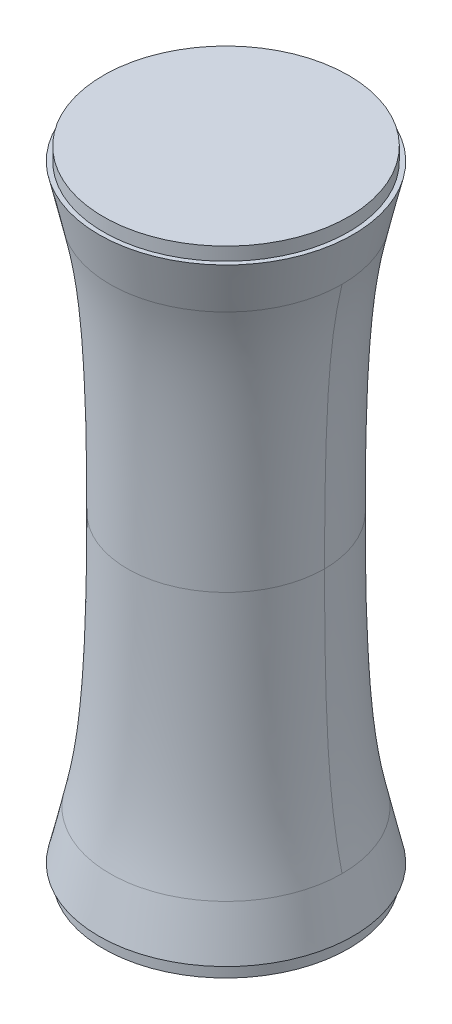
ISO-10303-21;
HEADER;
FILE_DESCRIPTION(('STEP AP214'),'2;1');
FILE_NAME('part.step','',(''),(''),'','','');
FILE_SCHEMA(('AUTOMOTIVE_DESIGN { 1 0 10303 214 1 1 1 1 }'));
ENDSEC;
DATA;
#1=APPLICATION_CONTEXT('core data for automotive mechanical design processes');
#2=APPLICATION_PROTOCOL_DEFINITION('international standard','automotive_design',2000,#1);
#3=PRODUCT_CONTEXT('',#1,'mechanical');
#4=PRODUCT('Part','Part','',(#3));
#5=PRODUCT_RELATED_PRODUCT_CATEGORY('part','',(#4));
#6=PRODUCT_DEFINITION_FORMATION('','',#4);
#7=PRODUCT_DEFINITION_CONTEXT('part definition',#1,'design');
#8=PRODUCT_DEFINITION('design','',#6,#7);
#9=PRODUCT_DEFINITION_SHAPE('','',#8);
#10=(LENGTH_UNIT() NAMED_UNIT(*) SI_UNIT(.MILLI.,.METRE.));
#11=(NAMED_UNIT(*) PLANE_ANGLE_UNIT() SI_UNIT($,.RADIAN.));
#12=(NAMED_UNIT(*) SI_UNIT($,.STERADIAN.) SOLID_ANGLE_UNIT());
#13=UNCERTAINTY_MEASURE_WITH_UNIT(LENGTH_MEASURE(1.E-05),#10,'distance_accuracy_value','');
#14=(GEOMETRIC_REPRESENTATION_CONTEXT(3) GLOBAL_UNCERTAINTY_ASSIGNED_CONTEXT((#13)) GLOBAL_UNIT_ASSIGNED_CONTEXT((#10,
#11,#12)) REPRESENTATION_CONTEXT('',''));
#15=CARTESIAN_POINT('',(0.,0.,0.));
#16=DIRECTION('',(0.,0.,1.));
#17=DIRECTION('',(1.,0.,0.));
#18=AXIS2_PLACEMENT_3D('',#15,#16,#17);
#19=CARTESIAN_POINT('',(0.,325.,0.));
#20=DIRECTION('',(0.,-1.,0.));
#21=DIRECTION('',(0.,0.,-1.));
#22=AXIS2_PLACEMENT_3D('',#19,#20,#21);
#23=PLANE('',#22);
#24=CARTESIAN_POINT('',(-151.8,325.,0.));
#25=DIRECTION('',(0.,1.,0.));
#26=DIRECTION('',(0.,0.,1.));
#27=AXIS2_PLACEMENT_3D('',#24,#25,#26);
#28=CIRCLE('',#27,39.);
#29=CARTESIAN_POINT('',(-151.8,325.,39.));
#30=VERTEX_POINT('',#29);
#31=EDGE_CURVE('P0_E28',#30,#30,#28,.F.);
#32=ORIENTED_EDGE('',*,*,#31,.F.);
#33=EDGE_LOOP('',(#32));
#34=FACE_BOUND('',#33,.T.);
#35=ADVANCED_FACE('P0_F16',(#34),#23,.F.);
#36=CARTESIAN_POINT('',(0.,85.,0.));
#37=DIRECTION('',(0.,1.,0.));
#38=DIRECTION('',(0.,0.,1.));
#39=AXIS2_PLACEMENT_3D('',#36,#37,#38);
#40=PLANE('',#39);
#41=CARTESIAN_POINT('',(-151.8,85.,0.));
#42=DIRECTION('',(0.,1.,0.));
#43=DIRECTION('',(0.,0.,1.));
#44=AXIS2_PLACEMENT_3D('',#41,#42,#43);
#45=CIRCLE('',#44,42.);
#46=CARTESIAN_POINT('',(-151.8,85.,42.));
#47=VERTEX_POINT('',#46);
#48=EDGE_CURVE('P0_E11',#47,#47,#45,.T.);
#49=ORIENTED_EDGE('',*,*,#48,.F.);
#50=EDGE_LOOP('',(#49));
#51=FACE_BOUND('',#50,.T.);
#52=ADVANCED_FACE('P0_F34',(#51),#40,.F.);
#53=CARTESIAN_POINT('',(-151.8,325.,0.));
#54=DIRECTION('',(0.,1.,0.));
#55=DIRECTION('',(0.,0.,1.));
#56=AXIS2_PLACEMENT_3D('',#53,#54,#55);
#57=PLANE('',#56);
#58=ORIENTED_EDGE('',*,*,#31,.T.);
#59=EDGE_LOOP('',(#58));
#60=FACE_BOUND('',#59,.T.);
#61=CARTESIAN_POINT('',(-151.8,325.,0.));
#62=DIRECTION('',(0.,1.,0.));
#63=DIRECTION('',(0.,0.,1.));
#64=AXIS2_PLACEMENT_3D('',#61,#62,#63);
#65=CIRCLE('',#64,42.);
#66=CARTESIAN_POINT('',(-151.8,325.,42.));
#67=VERTEX_POINT('',#66);
#68=EDGE_CURVE('P0_E23',#67,#67,#65,.T.);
#69=ORIENTED_EDGE('',*,*,#68,.T.);
#70=EDGE_LOOP('',(#69));
#71=FACE_BOUND('',#70,.T.);
#72=ADVANCED_FACE('P0_F36',(#60,#71),#57,.T.);
#73=CARTESIAN_POINT('',(-151.8,85.,0.));
#74=DIRECTION('',(0.,1.,0.));
#75=DIRECTION('',(0.,0.,1.));
#76=AXIS2_PLACEMENT_3D('',#73,#74,#75);
#77=CYLINDRICAL_SURFACE('',#76,42.);
#78=ORIENTED_EDGE('',*,*,#48,.T.);
#79=EDGE_LOOP('',(#78));
#80=FACE_BOUND('',#79,.T.);
#81=ORIENTED_EDGE('',*,*,#68,.F.);
#82=EDGE_LOOP('',(#81));
#83=FACE_BOUND('',#82,.T.);
#84=ADVANCED_FACE('P0_F31',(#80,#83),#77,.T.);
#85=CLOSED_SHELL('',(#35,#52,#72,#84));
#86=MANIFOLD_SOLID_BREP('P0_B1',#85);
#87=CARTESIAN_POINT('',(-98.7263979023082,322.381238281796,3.33910801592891));
#88=CARTESIAN_POINT('',(-99.4710295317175,319.117283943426,3.29225976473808));
#89=CARTESIAN_POINT('',(-100.907627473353,312.848644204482,3.2018766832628));
#90=CARTESIAN_POINT('',(-102.839590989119,300.827504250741,3.08032784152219));
#91=CARTESIAN_POINT('',(-104.599224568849,285.889672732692,2.96962108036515));
#92=CARTESIAN_POINT('',(-106.338383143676,259.421801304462,2.86020249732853));
#93=CARTESIAN_POINT('',(-106.899183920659,225.292783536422,2.82491990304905));
#94=CARTESIAN_POINT('',(-106.888502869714,203.819906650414,2.82559189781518));
#95=CARTESIAN_POINT('',(-98.5349992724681,322.381238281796,0.296913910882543));
#96=CARTESIAN_POINT('',(-99.2823162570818,319.117283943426,0.292748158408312));
#97=CARTESIAN_POINT('',(-100.724094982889,312.848644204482,0.284711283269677));
#98=CARTESIAN_POINT('',(-102.663025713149,300.827504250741,0.273903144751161));
#99=CARTESIAN_POINT('',(-104.429005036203,285.889672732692,0.2640590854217));
#100=CARTESIAN_POINT('',(-106.174435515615,259.421801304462,0.254329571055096));
#101=CARTESIAN_POINT('',(-106.737258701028,225.292783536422,0.251192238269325));
#102=CARTESIAN_POINT('',(-106.72653913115,203.819906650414,0.251251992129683));
#103=CARTESIAN_POINT('',(-98.6766339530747,322.381238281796,-5.82041718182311));
#104=CARTESIAN_POINT('',(-99.421963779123,319.117283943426,-5.73875574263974));
#105=CARTESIAN_POINT('',(-100.859908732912,312.848644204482,-5.58120850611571));
#106=CARTESIAN_POINT('',(-102.793683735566,300.827504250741,-5.36933606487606));
#107=CARTESIAN_POINT('',(-104.554967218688,285.889672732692,-5.17636251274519));
#108=CARTESIAN_POINT('',(-106.295756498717,259.421801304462,-4.9856343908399));
#109=CARTESIAN_POINT('',(-106.85708310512,225.292783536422,-4.92413311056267));
#110=CARTESIAN_POINT('',(-106.846392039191,203.819906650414,-4.92530446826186));
#111=CARTESIAN_POINT('',(-100.45610270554,322.381238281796,-14.8247657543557));
#112=CARTESIAN_POINT('',(-101.176466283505,319.117283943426,-14.6167717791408));
#113=CARTESIAN_POINT('',(-102.566244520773,312.848644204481,-14.215494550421));
#114=CARTESIAN_POINT('',(-104.435244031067,300.827504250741,-13.6758495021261));
#115=CARTESIAN_POINT('',(-106.137529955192,285.889672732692,-13.1843404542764));
#116=CARTESIAN_POINT('',(-107.820008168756,259.421801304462,-12.6985505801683));
#117=CARTESIAN_POINT('',(-108.362532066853,225.292783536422,-12.5419050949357));
#118=CARTESIAN_POINT('',(-108.352199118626,203.819906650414,-12.544888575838));
#119=CARTESIAN_POINT('',(-103.750101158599,322.381238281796,-23.3918062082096));
#120=CARTESIAN_POINT('',(-104.424249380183,319.117283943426,-23.0636152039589));
#121=CARTESIAN_POINT('',(-105.724865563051,312.848644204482,-22.4304450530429));
#122=CARTESIAN_POINT('',(-107.473958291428,300.827504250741,-21.5789461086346));
#123=CARTESIAN_POINT('',(-109.067033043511,285.889672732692,-20.8034003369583));
#124=CARTESIAN_POINT('',(-110.641570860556,259.421801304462,-20.0368787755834));
#125=CARTESIAN_POINT('',(-111.149288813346,225.292783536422,-19.7897098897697));
#126=CARTESIAN_POINT('',(-111.139618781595,203.819906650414,-19.7944174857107));
#127=CARTESIAN_POINT('',(-108.461462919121,322.381238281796,-31.2688441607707));
#128=CARTESIAN_POINT('',(-109.069509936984,319.117283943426,-30.8301369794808));
#129=CARTESIAN_POINT('',(-110.242598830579,312.848644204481,-29.9837509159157));
#130=CARTESIAN_POINT('',(-111.820190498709,300.827504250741,-28.845515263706));
#131=CARTESIAN_POINT('',(-113.257061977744,285.889672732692,-27.8088095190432));
#132=CARTESIAN_POINT('',(-114.677214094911,259.421801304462,-26.7841668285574));
#133=CARTESIAN_POINT('',(-115.13514957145,225.292783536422,-26.4537654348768));
#134=CARTESIAN_POINT('',(-115.126427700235,203.819906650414,-26.4600582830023));
#135=CARTESIAN_POINT('',(-114.451213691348,322.381238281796,-38.2235210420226));
#136=CARTESIAN_POINT('',(-114.975223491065,319.117283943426,-37.6872385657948));
#137=CARTESIAN_POINT('',(-115.986181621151,312.848644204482,-36.6526030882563));
#138=CARTESIAN_POINT('',(-117.34573683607,300.827504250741,-35.2612061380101));
#139=CARTESIAN_POINT('',(-118.584020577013,285.889672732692,-33.9939209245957));
#140=CARTESIAN_POINT('',(-119.807895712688,259.421801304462,-32.7413817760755));
#141=CARTESIAN_POINT('',(-120.20254065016,225.292783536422,-32.3374939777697));
#142=CARTESIAN_POINT('',(-120.195024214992,203.819906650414,-32.3451864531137));
#143=CARTESIAN_POINT('',(-121.542669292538,322.381238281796,-44.0506905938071));
#144=CARTESIAN_POINT('',(-121.967184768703,319.117283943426,-43.4326519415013));
#145=CARTESIAN_POINT('',(-122.786191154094,312.848644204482,-42.2402864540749));
#146=CARTESIAN_POINT('',(-123.887606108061,300.827504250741,-40.6367712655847));
#147=CARTESIAN_POINT('',(-124.890775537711,285.889672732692,-39.1762886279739));
#148=CARTESIAN_POINT('',(-125.882272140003,259.421801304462,-37.7328000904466));
#149=CARTESIAN_POINT('',(-126.201985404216,225.292783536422,-37.2673396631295));
#150=CARTESIAN_POINT('',(-126.195896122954,203.819906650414,-37.2762048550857));
#151=CARTESIAN_POINT('',(-129.526647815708,322.381238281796,-48.5784642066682));
#152=CARTESIAN_POINT('',(-129.839146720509,319.117283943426,-47.8969001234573));
#153=CARTESIAN_POINT('',(-130.442042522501,312.848644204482,-46.5819767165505));
#154=CARTESIAN_POINT('',(-131.252827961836,300.827504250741,-44.8136433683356));
#155=CARTESIAN_POINT('',(-131.991291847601,285.889672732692,-43.2030442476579));
#156=CARTESIAN_POINT('',(-132.721163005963,259.421801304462,-41.6111859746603));
#157=CARTESIAN_POINT('',(-132.95651377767,225.292783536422,-41.0978829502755));
#158=CARTESIAN_POINT('',(-132.952031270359,203.819906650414,-41.1076593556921));
#159=CARTESIAN_POINT('',(-138.167639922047,322.381238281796,-51.6732828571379));
#160=CARTESIAN_POINT('',(-138.358904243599,319.117283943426,-50.9482979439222));
#161=CARTESIAN_POINT('',(-138.727905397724,312.848644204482,-49.5496038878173));
#162=CARTESIAN_POINT('',(-139.224144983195,300.827504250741,-47.6686142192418));
#163=CARTESIAN_POINT('',(-139.676120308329,285.889672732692,-45.955407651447));
#164=CARTESIAN_POINT('',(-140.122836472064,259.421801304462,-44.2621358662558));
#165=CARTESIAN_POINT('',(-140.26688243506,225.292783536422,-43.7161315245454));
#166=CARTESIAN_POINT('',(-140.264138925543,203.819906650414,-43.7265307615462));
#167=CARTESIAN_POINT('',(-147.210755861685,322.381238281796,-53.2438563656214));
#168=CARTESIAN_POINT('',(-147.275143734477,319.117283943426,-52.4968360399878));
#169=CARTESIAN_POINT('',(-147.399365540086,312.848644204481,-51.0556296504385));
#170=CARTESIAN_POINT('',(-147.56642132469,300.827504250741,-49.1174686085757));
#171=CARTESIAN_POINT('',(-147.718575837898,285.889672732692,-47.3521903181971));
#172=CARTESIAN_POINT('',(-147.868959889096,259.421801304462,-45.6074527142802));
#173=CARTESIAN_POINT('',(-147.917452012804,225.292783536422,-45.0448529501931));
#174=CARTESIAN_POINT('',(-147.916528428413,203.819906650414,-45.0555682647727));
#175=CARTESIAN_POINT('',(-156.389244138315,322.381238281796,-53.2438563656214));
#176=CARTESIAN_POINT('',(-156.324856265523,319.117283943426,-52.4968360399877));
#177=CARTESIAN_POINT('',(-156.200634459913,312.848644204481,-51.0556296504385));
#178=CARTESIAN_POINT('',(-156.03357867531,300.827504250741,-49.1174686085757));
#179=CARTESIAN_POINT('',(-155.881424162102,285.889672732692,-47.3521903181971));
#180=CARTESIAN_POINT('',(-155.731040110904,259.421801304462,-45.6074527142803));
#181=CARTESIAN_POINT('',(-155.682547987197,225.292783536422,-45.0448529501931));
#182=CARTESIAN_POINT('',(-155.683471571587,203.819906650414,-45.0555682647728));
#183=CARTESIAN_POINT('',(-165.432360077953,322.381238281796,-51.6732828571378));
#184=CARTESIAN_POINT('',(-165.241095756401,319.117283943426,-50.9482979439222));
#185=CARTESIAN_POINT('',(-164.872094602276,312.848644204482,-49.5496038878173));
#186=CARTESIAN_POINT('',(-164.375855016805,300.827504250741,-47.6686142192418));
#187=CARTESIAN_POINT('',(-163.923879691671,285.889672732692,-45.955407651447));
#188=CARTESIAN_POINT('',(-163.477163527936,259.421801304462,-44.2621358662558));
#189=CARTESIAN_POINT('',(-163.33311756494,225.292783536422,-43.7161315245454));
#190=CARTESIAN_POINT('',(-163.335861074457,203.819906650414,-43.7265307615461));
#191=CARTESIAN_POINT('',(-174.073352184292,322.381238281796,-48.5784642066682));
#192=CARTESIAN_POINT('',(-173.760853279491,319.117283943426,-47.8969001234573));
#193=CARTESIAN_POINT('',(-173.1579574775,312.848644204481,-46.5819767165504));
#194=CARTESIAN_POINT('',(-172.347172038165,300.827504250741,-44.8136433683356));
#195=CARTESIAN_POINT('',(-171.608708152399,285.889672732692,-43.2030442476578));
#196=CARTESIAN_POINT('',(-170.878836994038,259.421801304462,-41.6111859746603));
#197=CARTESIAN_POINT('',(-170.64348622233,225.292783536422,-41.0978829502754));
#198=CARTESIAN_POINT('',(-170.647968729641,203.819906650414,-41.107659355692));
#199=CARTESIAN_POINT('',(-182.057330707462,322.381238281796,-44.0506905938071));
#200=CARTESIAN_POINT('',(-181.632815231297,319.117283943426,-43.4326519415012));
#201=CARTESIAN_POINT('',(-180.813808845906,312.848644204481,-42.2402864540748));
#202=CARTESIAN_POINT('',(-179.71239389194,300.827504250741,-40.6367712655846));
#203=CARTESIAN_POINT('',(-178.709224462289,285.889672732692,-39.1762886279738));
#204=CARTESIAN_POINT('',(-177.717727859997,259.421801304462,-37.7328000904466));
#205=CARTESIAN_POINT('',(-177.398014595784,225.292783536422,-37.2673396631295));
#206=CARTESIAN_POINT('',(-177.404103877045,203.819906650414,-37.2762048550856));
#207=CARTESIAN_POINT('',(-189.148786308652,322.381238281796,-38.2235210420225));
#208=CARTESIAN_POINT('',(-188.624776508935,319.117283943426,-37.6872385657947));
#209=CARTESIAN_POINT('',(-187.61381837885,312.848644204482,-36.6526030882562));
#210=CARTESIAN_POINT('',(-186.254263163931,300.827504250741,-35.2612061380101));
#211=CARTESIAN_POINT('',(-185.015979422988,285.889672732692,-33.9939209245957));
#212=CARTESIAN_POINT('',(-183.792104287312,259.421801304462,-32.7413817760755));
#213=CARTESIAN_POINT('',(-183.397459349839,225.292783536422,-32.3374939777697));
#214=CARTESIAN_POINT('',(-183.404975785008,203.819906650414,-32.3451864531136));
#215=CARTESIAN_POINT('',(-195.138537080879,322.381238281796,-31.2688441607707));
#216=CARTESIAN_POINT('',(-194.530490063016,319.117283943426,-30.8301369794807));
#217=CARTESIAN_POINT('',(-193.35740116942,312.848644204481,-29.9837509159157));
#218=CARTESIAN_POINT('',(-191.779809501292,300.827504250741,-28.845515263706));
#219=CARTESIAN_POINT('',(-190.342938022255,285.889672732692,-27.8088095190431));
#220=CARTESIAN_POINT('',(-188.922785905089,259.421801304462,-26.7841668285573));
#221=CARTESIAN_POINT('',(-188.464850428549,225.292783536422,-26.4537654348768));
#222=CARTESIAN_POINT('',(-188.473572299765,203.819906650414,-26.4600582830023));
#223=CARTESIAN_POINT('',(-199.849898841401,322.381238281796,-23.3918062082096));
#224=CARTESIAN_POINT('',(-199.175750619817,319.117283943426,-23.0636152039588));
#225=CARTESIAN_POINT('',(-197.875134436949,312.848644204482,-22.4304450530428));
#226=CARTESIAN_POINT('',(-196.126041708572,300.827504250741,-21.5789461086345));
#227=CARTESIAN_POINT('',(-194.532966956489,285.889672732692,-20.8034003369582));
#228=CARTESIAN_POINT('',(-192.958429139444,259.421801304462,-20.0368787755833));
#229=CARTESIAN_POINT('',(-192.450711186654,225.292783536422,-19.7897098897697));
#230=CARTESIAN_POINT('',(-192.460381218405,203.819906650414,-19.7944174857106));
#231=CARTESIAN_POINT('',(-203.14389729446,322.381238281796,-14.8247657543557));
#232=CARTESIAN_POINT('',(-202.423533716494,319.117283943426,-14.6167717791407));
#233=CARTESIAN_POINT('',(-201.033755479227,312.848644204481,-14.215494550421));
#234=CARTESIAN_POINT('',(-199.164755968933,300.827504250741,-13.6758495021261));
#235=CARTESIAN_POINT('',(-197.462470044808,285.889672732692,-13.1843404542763));
#236=CARTESIAN_POINT('',(-195.779991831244,259.421801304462,-12.6985505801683));
#237=CARTESIAN_POINT('',(-195.237467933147,225.292783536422,-12.5419050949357));
#238=CARTESIAN_POINT('',(-195.247800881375,203.819906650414,-12.5448885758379));
#239=CARTESIAN_POINT('',(-204.923366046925,322.381238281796,-5.82041718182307));
#240=CARTESIAN_POINT('',(-204.178036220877,319.117283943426,-5.7387557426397));
#241=CARTESIAN_POINT('',(-202.740091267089,312.848644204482,-5.58120850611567));
#242=CARTESIAN_POINT('',(-200.806316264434,300.827504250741,-5.36933606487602));
#243=CARTESIAN_POINT('',(-199.045032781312,285.889672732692,-5.17636251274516));
#244=CARTESIAN_POINT('',(-197.304243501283,259.421801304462,-4.98563439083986));
#245=CARTESIAN_POINT('',(-196.74291689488,225.292783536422,-4.92413311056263));
#246=CARTESIAN_POINT('',(-196.753607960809,203.819906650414,-4.92530446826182));
#247=CARTESIAN_POINT('',(-205.065000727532,322.381238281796,0.29691391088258));
#248=CARTESIAN_POINT('',(-204.317683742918,319.117283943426,0.292748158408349));
#249=CARTESIAN_POINT('',(-202.875905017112,312.848644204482,0.284711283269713));
#250=CARTESIAN_POINT('',(-200.936974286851,300.827504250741,0.273903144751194));
#251=CARTESIAN_POINT('',(-199.170994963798,285.889672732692,0.264059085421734));
#252=CARTESIAN_POINT('',(-197.425564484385,259.421801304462,0.254329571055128));
#253=CARTESIAN_POINT('',(-196.862741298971,225.292783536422,0.251192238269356));
#254=CARTESIAN_POINT('',(-196.87346086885,203.819906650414,0.251251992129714));
#255=CARTESIAN_POINT('',(-204.873602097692,322.381238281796,3.33910801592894));
#256=CARTESIAN_POINT('',(-204.128970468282,319.117283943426,3.29225976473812));
#257=CARTESIAN_POINT('',(-202.692372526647,312.848644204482,3.20187668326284));
#258=CARTESIAN_POINT('',(-200.760409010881,300.827504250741,3.08032784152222));
#259=CARTESIAN_POINT('',(-199.000775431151,285.889672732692,2.96962108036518));
#260=CARTESIAN_POINT('',(-197.261616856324,259.421801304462,2.86020249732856));
#261=CARTESIAN_POINT('',(-196.700816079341,225.292783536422,2.82491990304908));
#262=CARTESIAN_POINT('',(-196.711497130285,203.819906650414,2.82559189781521));
#263=B_SPLINE_SURFACE_WITH_KNOTS('',3,3,((#87,#88,#89,#90,#91,#92,#93,#94),(#95,#96,#97,#98,#99,
#100,#101,#102),(#103,#104,#105,#106,#107,#108,#109,#110),(#111,#112,#113,#114,#115,#116,#117,
#118),(#119,#120,#121,#122,#123,#124,#125,#126),(#127,#128,#129,#130,#131,#132,#133,#134),(#135,
#136,#137,#138,#139,#140,#141,#142),(#143,#144,#145,#146,#147,#148,#149,#150),(#151,#152,#153,
#154,#155,#156,#157,#158),(#159,#160,#161,#162,#163,#164,#165,#166),(#167,#168,#169,#170,#171,
#172,#173,#174),(#175,#176,#177,#178,#179,#180,#181,#182),(#183,#184,#185,#186,#187,#188,#189,
#190),(#191,#192,#193,#194,#195,#196,#197,#198),(#199,#200,#201,#202,#203,#204,#205,#206),(#207,
#208,#209,#210,#211,#212,#213,#214),(#215,#216,#217,#218,#219,#220,#221,#222),(#223,#224,#225,
#226,#227,#228,#229,#230),(#231,#232,#233,#234,#235,#236,#237,#238),(#239,#240,#241,#242,#243,
#244,#245,#246),(#247,#248,#249,#250,#251,#252,#253,#254),(#255,#256,#257,#258,#259,#260,#261,
#262)),.UNSPECIFIED.,.F.,.F.,.F.,(4,1,1,1,1,1,1,1,1,1,1,1,1,1,1,1,1,1,1,4),(4,1,1,1,1,4),(0.,
0.0526315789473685,0.105263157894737,0.157894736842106,0.210526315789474,0.263157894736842,
0.315789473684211,0.36842105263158,0.421052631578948,0.473684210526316,0.526315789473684,
0.578947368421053,0.631578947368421,0.68421052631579,0.736842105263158,0.789473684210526,
0.842105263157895,0.894736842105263,0.947368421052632,1.),(0.,0.25,0.375,0.5,0.75,1.),.UNSPECIFIED.);
#264=CARTESIAN_POINT('',(-98.621566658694,322.381238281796,1.41827027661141E-07));
#265=CARTESIAN_POINT('',(-99.3676690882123,319.117283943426,1.39837169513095E-07));
#266=CARTESIAN_POINT('',(-100.807104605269,312.848644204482,1.3599819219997E-07));
#267=CARTESIAN_POINT('',(-102.742884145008,300.827504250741,1.30835463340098E-07));
#268=CARTESIAN_POINT('',(-104.505993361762,285.889672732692,1.26133246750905E-07));
#269=CARTESIAN_POINT('',(-106.248587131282,259.421801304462,1.21485742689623E-07));
#270=CARTESIAN_POINT('',(-106.810495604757,225.292783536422,1.19987131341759E-07));
#271=CARTESIAN_POINT('',(-106.799793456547,203.819906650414,1.2001567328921E-07));
#272=B_SPLINE_CURVE_WITH_KNOTS('',3,(#264,#265,#266,#267,#268,#269,#270,#271),.UNSPECIFIED.,.F.,
.F.,(4,1,1,1,1,4),(0.,0.25,0.375,0.5,0.75,1.),.UNSPECIFIED.);
#273=CARTESIAN_POINT('',(-106.80008850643,205.,-2.09772099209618E-07));
#274=VERTEX_POINT('',#273);
#275=CARTESIAN_POINT('',(-98.8000539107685,321.599973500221,-4.57075249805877E-08));
#276=VERTEX_POINT('',#275);
#277=EDGE_CURVE('P1_E58',#274,#276,#272,.F.);
#278=CARTESIAN_POINT('',(-196.711202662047,205.,2.82557337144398));
#279=CARTESIAN_POINT('',(-196.873165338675,205.,0.251250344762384));
#280=CARTESIAN_POINT('',(-196.753313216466,205.,-4.92527217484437));
#281=CARTESIAN_POINT('',(-195.247516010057,205.,-12.5448063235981));
#282=CARTESIAN_POINT('',(-192.460114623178,205.,-19.794287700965));
#283=CARTESIAN_POINT('',(-188.473331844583,205.,-26.4598847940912));
#284=CARTESIAN_POINT('',(-183.404768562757,205.,-32.3449743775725));
#285=CARTESIAN_POINT('',(-177.403936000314,205.,-37.2759604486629));
#286=CARTESIAN_POINT('',(-170.647845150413,205.,-41.1073898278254));
#287=CARTESIAN_POINT('',(-163.335785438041,205.,-43.726244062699));
#288=CARTESIAN_POINT('',(-155.683446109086,205.,-45.0552728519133));
#289=CARTESIAN_POINT('',(-147.916553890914,205.,-45.0552728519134));
#290=CARTESIAN_POINT('',(-140.264214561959,205.,-43.726244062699));
#291=CARTESIAN_POINT('',(-132.952154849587,205.,-41.1073898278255));
#292=CARTESIAN_POINT('',(-126.196063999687,205.,-37.275960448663));
#293=CARTESIAN_POINT('',(-120.195231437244,205.,-32.3449743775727));
#294=CARTESIAN_POINT('',(-115.126668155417,205.,-26.4598847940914));
#295=CARTESIAN_POINT('',(-111.139885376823,205.,-19.7942877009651));
#296=CARTESIAN_POINT('',(-108.352483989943,205.,-12.5448063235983));
#297=CARTESIAN_POINT('',(-106.846686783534,205.,-4.92527217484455));
#298=CARTESIAN_POINT('',(-106.726834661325,205.,0.251250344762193));
#299=CARTESIAN_POINT('',(-106.888797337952,205.,2.82557337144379));
#300=B_SPLINE_CURVE_WITH_KNOTS('',3,(#278,#279,#280,#281,#282,#283,#284,#285,#286,#287,#288,
#289,#290,#291,#292,#293,#294,#295,#296,#297,#298,#299),.UNSPECIFIED.,.F.,.F.,(4,1,1,1,1,1,1,1,
1,1,1,1,1,1,1,1,1,1,1,4),(0.,0.0526315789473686,0.105263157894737,0.157894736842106,
0.210526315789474,0.263157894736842,0.315789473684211,0.368421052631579,0.421052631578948,
0.473684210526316,0.526315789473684,0.578947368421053,0.631578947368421,0.68421052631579,
0.736842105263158,0.789473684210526,0.842105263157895,0.894736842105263,0.947368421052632,1.),.UNSPECIFIED.);
#301=CARTESIAN_POINT('',(-196.799911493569,205.,-4.53975312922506E-07));
#302=VERTEX_POINT('',#301);
#303=EDGE_CURVE('P1_E59',#274,#302,#300,.F.);
#304=CARTESIAN_POINT('',(-204.978433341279,322.381238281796,-8.69475796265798E-07));
#305=CARTESIAN_POINT('',(-204.232330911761,319.117283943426,-8.57276900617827E-07));
#306=CARTESIAN_POINT('',(-202.792895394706,312.848644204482,-8.33741901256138E-07));
#307=CARTESIAN_POINT('',(-200.857115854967,300.827504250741,-8.02091602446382E-07));
#308=CARTESIAN_POINT('',(-199.094006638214,285.889672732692,-7.73264486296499E-07));
#309=CARTESIAN_POINT('',(-197.351412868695,259.421801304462,-7.44772803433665E-07));
#310=CARTESIAN_POINT('',(-196.789504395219,225.292783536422,-7.35585511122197E-07));
#311=CARTESIAN_POINT('',(-196.80020654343,203.819906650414,-7.35760492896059E-07));
#312=B_SPLINE_CURVE_WITH_KNOTS('',3,(#304,#305,#306,#307,#308,#309,#310,#311),.UNSPECIFIED.,.F.,
.F.,(4,1,1,1,1,4),(0.,0.25,0.375,0.5,0.75,1.),.UNSPECIFIED.);
#313=CARTESIAN_POINT('',(-204.799946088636,321.599973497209,-8.67394622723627E-07));
#314=VERTEX_POINT('',#313);
#315=EDGE_CURVE('P1_E71',#314,#302,#312,.T.);
#316=CARTESIAN_POINT('',(-204.695421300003,321.5999838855,3.32789783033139));
#317=CARTESIAN_POINT('',(-204.886177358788,321.5999838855,0.295917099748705));
#318=CARTESIAN_POINT('',(-204.745018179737,321.5999838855,-5.80087664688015));
#319=CARTESIAN_POINT('',(-202.971523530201,321.5999838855,-14.7749954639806));
#320=CARTESIAN_POINT('',(-199.68858381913,321.5999838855,-23.3132743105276));
#321=CARTESIAN_POINT('',(-194.993039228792,321.5999838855,-31.1638671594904));
#322=CARTESIAN_POINT('',(-189.02339748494,321.5999838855,-38.0951955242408));
#323=CARTESIAN_POINT('',(-181.955749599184,321.5999838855,-43.9028018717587));
#324=CARTESIAN_POINT('',(-173.998575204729,321.5999838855,-48.4153746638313));
#325=CARTESIAN_POINT('',(-165.386592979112,321.5999838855,-51.4998032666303));
#326=CARTESIAN_POINT('',(-156.373836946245,321.5999838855,-53.0651039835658));
#327=CARTESIAN_POINT('',(-147.226163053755,321.5999838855,-53.0651039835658));
#328=CARTESIAN_POINT('',(-138.213407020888,321.5999838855,-51.4998032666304));
#329=CARTESIAN_POINT('',(-129.601424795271,321.5999838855,-48.4153746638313));
#330=CARTESIAN_POINT('',(-121.644250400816,321.5999838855,-43.9028018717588));
#331=CARTESIAN_POINT('',(-114.57660251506,321.5999838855,-38.0951955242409));
#332=CARTESIAN_POINT('',(-108.606960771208,321.5999838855,-31.1638671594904));
#333=CARTESIAN_POINT('',(-103.91141618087,321.5999838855,-23.3132743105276));
#334=CARTESIAN_POINT('',(-100.628476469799,321.5999838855,-14.7749954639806));
#335=CARTESIAN_POINT('',(-98.8549818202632,321.5999838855,-5.80087664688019));
#336=CARTESIAN_POINT('',(-98.7138226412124,321.5999838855,0.295917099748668));
#337=CARTESIAN_POINT('',(-98.9045786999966,321.5999838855,3.32789783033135));
#338=B_SPLINE_CURVE_WITH_KNOTS('',3,(#316,#317,#318,#319,#320,#321,#322,#323,#324,#325,#326,
#327,#328,#329,#330,#331,#332,#333,#334,#335,#336,#337),.UNSPECIFIED.,.F.,.F.,(4,1,1,1,1,1,1,1,
1,1,1,1,1,1,1,1,1,1,1,4),(0.,0.052631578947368,0.105263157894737,0.157894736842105,
0.210526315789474,0.263157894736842,0.31578947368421,0.368421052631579,0.421052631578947,
0.473684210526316,0.526315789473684,0.578947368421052,0.63157894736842,0.684210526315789,
0.736842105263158,0.789473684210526,0.842105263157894,0.894736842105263,0.947368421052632,1.),.UNSPECIFIED.);
#339=EDGE_CURVE('P1_E62',#276,#314,#338,.F.);
#340=ORIENTED_EDGE('',*,*,#277,.F.);
#341=ORIENTED_EDGE('',*,*,#303,.T.);
#342=ORIENTED_EDGE('',*,*,#315,.F.);
#343=ORIENTED_EDGE('',*,*,#339,.F.);
#344=EDGE_LOOP('',(#340,#341,#342,#343));
#345=FACE_BOUND('',#344,.T.);
#346=ADVANCED_FACE('P1_F16',(#345),#263,.F.);
#347=CARTESIAN_POINT('',(-204.873602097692,322.381238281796,-3.33910801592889));
#348=CARTESIAN_POINT('',(-204.128970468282,319.117283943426,-3.29225976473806));
#349=CARTESIAN_POINT('',(-202.692372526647,312.848644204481,-3.20187668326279));
#350=CARTESIAN_POINT('',(-200.760409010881,300.827504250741,-3.08032784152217));
#351=CARTESIAN_POINT('',(-199.000775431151,285.889672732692,-2.96962108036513));
#352=CARTESIAN_POINT('',(-197.261616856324,259.421801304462,-2.86020249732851));
#353=CARTESIAN_POINT('',(-196.700816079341,225.292783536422,-2.82491990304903));
#354=CARTESIAN_POINT('',(-196.711497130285,203.819906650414,-2.82559189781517));
#355=CARTESIAN_POINT('',(-205.065000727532,322.381238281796,-0.296913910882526));
#356=CARTESIAN_POINT('',(-204.317683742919,319.117283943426,-0.292748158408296));
#357=CARTESIAN_POINT('',(-202.875905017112,312.848644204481,-0.284711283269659));
#358=CARTESIAN_POINT('',(-200.936974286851,300.827504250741,-0.273903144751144));
#359=CARTESIAN_POINT('',(-199.170994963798,285.889672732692,-0.264059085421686));
#360=CARTESIAN_POINT('',(-197.425564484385,259.421801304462,-0.254329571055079));
#361=CARTESIAN_POINT('',(-196.862741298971,225.292783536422,-0.25119223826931));
#362=CARTESIAN_POINT('',(-196.87346086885,203.819906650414,-0.251251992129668));
#363=CARTESIAN_POINT('',(-204.923366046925,322.381238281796,5.82041718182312));
#364=CARTESIAN_POINT('',(-204.178036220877,319.117283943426,5.73875574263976));
#365=CARTESIAN_POINT('',(-202.740091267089,312.848644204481,5.58120850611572));
#366=CARTESIAN_POINT('',(-200.806316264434,300.827504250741,5.36933606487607));
#367=CARTESIAN_POINT('',(-199.045032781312,285.889672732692,5.17636251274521));
#368=CARTESIAN_POINT('',(-197.304243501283,259.421801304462,4.98563439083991));
#369=CARTESIAN_POINT('',(-196.74291689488,225.292783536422,4.92413311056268));
#370=CARTESIAN_POINT('',(-196.753607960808,203.819906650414,4.92530446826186));
#371=CARTESIAN_POINT('',(-203.14389729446,322.381238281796,14.8247657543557));
#372=CARTESIAN_POINT('',(-202.423533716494,319.117283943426,14.6167717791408));
#373=CARTESIAN_POINT('',(-201.033755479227,312.848644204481,14.215494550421));
#374=CARTESIAN_POINT('',(-199.164755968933,300.827504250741,13.6758495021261));
#375=CARTESIAN_POINT('',(-197.462470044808,285.889672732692,13.1843404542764));
#376=CARTESIAN_POINT('',(-195.779991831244,259.421801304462,12.6985505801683));
#377=CARTESIAN_POINT('',(-195.237467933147,225.292783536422,12.5419050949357));
#378=CARTESIAN_POINT('',(-195.247800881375,203.819906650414,12.544888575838));
#379=CARTESIAN_POINT('',(-199.849898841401,322.381238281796,23.3918062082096));
#380=CARTESIAN_POINT('',(-199.175750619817,319.117283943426,23.0636152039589));
#381=CARTESIAN_POINT('',(-197.875134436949,312.848644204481,22.4304450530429));
#382=CARTESIAN_POINT('',(-196.126041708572,300.827504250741,21.5789461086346));
#383=CARTESIAN_POINT('',(-194.532966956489,285.889672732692,20.8034003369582));
#384=CARTESIAN_POINT('',(-192.958429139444,259.421801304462,20.0368787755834));
#385=CARTESIAN_POINT('',(-192.450711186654,225.292783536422,19.7897098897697));
#386=CARTESIAN_POINT('',(-192.460381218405,203.819906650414,19.7944174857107));
#387=CARTESIAN_POINT('',(-195.138537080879,322.381238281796,31.2688441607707));
#388=CARTESIAN_POINT('',(-194.530490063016,319.117283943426,30.8301369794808));
#389=CARTESIAN_POINT('',(-193.35740116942,312.848644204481,29.9837509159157));
#390=CARTESIAN_POINT('',(-191.779809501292,300.827504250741,28.845515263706));
#391=CARTESIAN_POINT('',(-190.342938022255,285.889672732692,27.8088095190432));
#392=CARTESIAN_POINT('',(-188.922785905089,259.421801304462,26.7841668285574));
#393=CARTESIAN_POINT('',(-188.464850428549,225.292783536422,26.4537654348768));
#394=CARTESIAN_POINT('',(-188.473572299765,203.819906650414,26.4600582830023));
#395=CARTESIAN_POINT('',(-189.148786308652,322.381238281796,38.2235210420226));
#396=CARTESIAN_POINT('',(-188.624776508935,319.117283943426,37.6872385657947));
#397=CARTESIAN_POINT('',(-187.61381837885,312.848644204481,36.6526030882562));
#398=CARTESIAN_POINT('',(-186.254263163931,300.827504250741,35.2612061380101));
#399=CARTESIAN_POINT('',(-185.015979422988,285.889672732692,33.9939209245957));
#400=CARTESIAN_POINT('',(-183.792104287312,259.421801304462,32.7413817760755));
#401=CARTESIAN_POINT('',(-183.397459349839,225.292783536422,32.3374939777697));
#402=CARTESIAN_POINT('',(-183.404975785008,203.819906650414,32.3451864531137));
#403=CARTESIAN_POINT('',(-182.057330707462,322.381238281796,44.0506905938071));
#404=CARTESIAN_POINT('',(-181.632815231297,319.117283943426,43.4326519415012));
#405=CARTESIAN_POINT('',(-180.813808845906,312.848644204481,42.2402864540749));
#406=CARTESIAN_POINT('',(-179.71239389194,300.827504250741,40.6367712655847));
#407=CARTESIAN_POINT('',(-178.709224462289,285.889672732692,39.1762886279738));
#408=CARTESIAN_POINT('',(-177.717727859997,259.421801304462,37.7328000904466));
#409=CARTESIAN_POINT('',(-177.398014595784,225.292783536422,37.2673396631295));
#410=CARTESIAN_POINT('',(-177.404103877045,203.819906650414,37.2762048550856));
#411=CARTESIAN_POINT('',(-174.073352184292,322.381238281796,48.5784642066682));
#412=CARTESIAN_POINT('',(-173.760853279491,319.117283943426,47.8969001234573));
#413=CARTESIAN_POINT('',(-173.157957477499,312.848644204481,46.5819767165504));
#414=CARTESIAN_POINT('',(-172.347172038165,300.827504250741,44.8136433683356));
#415=CARTESIAN_POINT('',(-171.608708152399,285.889672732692,43.2030442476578));
#416=CARTESIAN_POINT('',(-170.878836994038,259.421801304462,41.6111859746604));
#417=CARTESIAN_POINT('',(-170.64348622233,225.292783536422,41.0978829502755));
#418=CARTESIAN_POINT('',(-170.647968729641,203.819906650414,41.1076593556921));
#419=CARTESIAN_POINT('',(-165.432360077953,322.381238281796,51.6732828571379));
#420=CARTESIAN_POINT('',(-165.241095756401,319.117283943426,50.9482979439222));
#421=CARTESIAN_POINT('',(-164.872094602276,312.848644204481,49.5496038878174));
#422=CARTESIAN_POINT('',(-164.375855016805,300.827504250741,47.6686142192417));
#423=CARTESIAN_POINT('',(-163.923879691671,285.889672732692,45.9554076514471));
#424=CARTESIAN_POINT('',(-163.477163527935,259.421801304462,44.2621358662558));
#425=CARTESIAN_POINT('',(-163.33311756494,225.292783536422,43.7161315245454));
#426=CARTESIAN_POINT('',(-163.335861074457,203.819906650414,43.7265307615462));
#427=CARTESIAN_POINT('',(-156.389244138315,322.381238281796,53.2438563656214));
#428=CARTESIAN_POINT('',(-156.324856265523,319.117283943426,52.4968360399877));
#429=CARTESIAN_POINT('',(-156.200634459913,312.848644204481,51.0556296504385));
#430=CARTESIAN_POINT('',(-156.03357867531,300.827504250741,49.1174686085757));
#431=CARTESIAN_POINT('',(-155.881424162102,285.889672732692,47.3521903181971));
#432=CARTESIAN_POINT('',(-155.731040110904,259.421801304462,45.6074527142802));
#433=CARTESIAN_POINT('',(-155.682547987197,225.292783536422,45.0448529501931));
#434=CARTESIAN_POINT('',(-155.683471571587,203.819906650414,45.0555682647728));
#435=CARTESIAN_POINT('',(-147.210755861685,322.381238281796,53.2438563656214));
#436=CARTESIAN_POINT('',(-147.275143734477,319.117283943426,52.4968360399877));
#437=CARTESIAN_POINT('',(-147.399365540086,312.848644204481,51.0556296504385));
#438=CARTESIAN_POINT('',(-147.56642132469,300.827504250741,49.1174686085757));
#439=CARTESIAN_POINT('',(-147.718575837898,285.889672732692,47.3521903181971));
#440=CARTESIAN_POINT('',(-147.868959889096,259.421801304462,45.6074527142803));
#441=CARTESIAN_POINT('',(-147.917452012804,225.292783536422,45.0448529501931));
#442=CARTESIAN_POINT('',(-147.916528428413,203.819906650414,45.0555682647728));
#443=CARTESIAN_POINT('',(-138.167639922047,322.381238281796,51.6732828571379));
#444=CARTESIAN_POINT('',(-138.358904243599,319.117283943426,50.9482979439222));
#445=CARTESIAN_POINT('',(-138.727905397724,312.848644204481,49.5496038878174));
#446=CARTESIAN_POINT('',(-139.224144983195,300.827504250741,47.6686142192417));
#447=CARTESIAN_POINT('',(-139.676120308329,285.889672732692,45.9554076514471));
#448=CARTESIAN_POINT('',(-140.122836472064,259.421801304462,44.2621358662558));
#449=CARTESIAN_POINT('',(-140.26688243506,225.292783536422,43.7161315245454));
#450=CARTESIAN_POINT('',(-140.264138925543,203.819906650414,43.7265307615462));
#451=CARTESIAN_POINT('',(-129.526647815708,322.381238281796,48.5784642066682));
#452=CARTESIAN_POINT('',(-129.839146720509,319.117283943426,47.8969001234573));
#453=CARTESIAN_POINT('',(-130.442042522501,312.848644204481,46.5819767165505));
#454=CARTESIAN_POINT('',(-131.252827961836,300.827504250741,44.8136433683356));
#455=CARTESIAN_POINT('',(-131.991291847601,285.889672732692,43.2030442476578));
#456=CARTESIAN_POINT('',(-132.721163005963,259.421801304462,41.6111859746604));
#457=CARTESIAN_POINT('',(-132.95651377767,225.292783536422,41.0978829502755));
#458=CARTESIAN_POINT('',(-132.952031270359,203.819906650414,41.107659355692));
#459=CARTESIAN_POINT('',(-121.542669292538,322.381238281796,44.0506905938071));
#460=CARTESIAN_POINT('',(-121.967184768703,319.117283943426,43.4326519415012));
#461=CARTESIAN_POINT('',(-122.786191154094,312.848644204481,42.2402864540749));
#462=CARTESIAN_POINT('',(-123.887606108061,300.827504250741,40.6367712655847));
#463=CARTESIAN_POINT('',(-124.890775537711,285.889672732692,39.1762886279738));
#464=CARTESIAN_POINT('',(-125.882272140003,259.421801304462,37.7328000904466));
#465=CARTESIAN_POINT('',(-126.201985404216,225.292783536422,37.2673396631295));
#466=CARTESIAN_POINT('',(-126.195896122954,203.819906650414,37.2762048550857));
#467=CARTESIAN_POINT('',(-114.451213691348,322.381238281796,38.2235210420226));
#468=CARTESIAN_POINT('',(-114.975223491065,319.117283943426,37.6872385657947));
#469=CARTESIAN_POINT('',(-115.986181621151,312.848644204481,36.6526030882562));
#470=CARTESIAN_POINT('',(-117.34573683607,300.827504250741,35.2612061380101));
#471=CARTESIAN_POINT('',(-118.584020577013,285.889672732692,33.9939209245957));
#472=CARTESIAN_POINT('',(-119.807895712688,259.421801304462,32.7413817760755));
#473=CARTESIAN_POINT('',(-120.20254065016,225.292783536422,32.3374939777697));
#474=CARTESIAN_POINT('',(-120.195024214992,203.819906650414,32.3451864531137));
#475=CARTESIAN_POINT('',(-108.461462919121,322.381238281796,31.2688441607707));
#476=CARTESIAN_POINT('',(-109.069509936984,319.117283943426,30.8301369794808));
#477=CARTESIAN_POINT('',(-110.242598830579,312.848644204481,29.9837509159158));
#478=CARTESIAN_POINT('',(-111.820190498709,300.827504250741,28.845515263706));
#479=CARTESIAN_POINT('',(-113.257061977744,285.889672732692,27.8088095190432));
#480=CARTESIAN_POINT('',(-114.677214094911,259.421801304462,26.7841668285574));
#481=CARTESIAN_POINT('',(-115.13514957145,225.292783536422,26.4537654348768));
#482=CARTESIAN_POINT('',(-115.126427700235,203.819906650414,26.4600582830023));
#483=CARTESIAN_POINT('',(-103.750101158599,322.381238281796,23.3918062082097));
#484=CARTESIAN_POINT('',(-104.424249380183,319.117283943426,23.0636152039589));
#485=CARTESIAN_POINT('',(-105.724865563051,312.848644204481,22.4304450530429));
#486=CARTESIAN_POINT('',(-107.473958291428,300.827504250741,21.5789461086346));
#487=CARTESIAN_POINT('',(-109.067033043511,285.889672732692,20.8034003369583));
#488=CARTESIAN_POINT('',(-110.641570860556,259.421801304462,20.0368787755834));
#489=CARTESIAN_POINT('',(-111.149288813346,225.292783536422,19.7897098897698));
#490=CARTESIAN_POINT('',(-111.139618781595,203.819906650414,19.7944174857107));
#491=CARTESIAN_POINT('',(-100.45610270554,322.381238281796,14.8247657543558));
#492=CARTESIAN_POINT('',(-101.176466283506,319.117283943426,14.6167717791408));
#493=CARTESIAN_POINT('',(-102.566244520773,312.848644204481,14.2154945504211));
#494=CARTESIAN_POINT('',(-104.435244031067,300.827504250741,13.6758495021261));
#495=CARTESIAN_POINT('',(-106.137529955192,285.889672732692,13.1843404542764));
#496=CARTESIAN_POINT('',(-107.820008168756,259.421801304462,12.6985505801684));
#497=CARTESIAN_POINT('',(-108.362532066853,225.292783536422,12.5419050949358));
#498=CARTESIAN_POINT('',(-108.352199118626,203.819906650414,12.544888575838));
#499=CARTESIAN_POINT('',(-98.6766339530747,322.381238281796,5.82041718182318));
#500=CARTESIAN_POINT('',(-99.421963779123,319.117283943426,5.73875574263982));
#501=CARTESIAN_POINT('',(-100.859908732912,312.848644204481,5.58120850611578));
#502=CARTESIAN_POINT('',(-102.793683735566,300.827504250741,5.36933606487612));
#503=CARTESIAN_POINT('',(-104.554967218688,285.889672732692,5.17636251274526));
#504=CARTESIAN_POINT('',(-106.295756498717,259.421801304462,4.98563439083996));
#505=CARTESIAN_POINT('',(-106.85708310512,225.292783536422,4.92413311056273));
#506=CARTESIAN_POINT('',(-106.846392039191,203.819906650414,4.92530446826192));
#507=CARTESIAN_POINT('',(-98.5349992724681,322.381238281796,-0.296913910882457));
#508=CARTESIAN_POINT('',(-99.2823162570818,319.117283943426,-0.292748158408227));
#509=CARTESIAN_POINT('',(-100.724094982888,312.848644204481,-0.284711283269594));
#510=CARTESIAN_POINT('',(-102.663025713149,300.827504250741,-0.273903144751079));
#511=CARTESIAN_POINT('',(-104.429005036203,285.889672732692,-0.264059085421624));
#512=CARTESIAN_POINT('',(-106.174435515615,259.421801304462,-0.254329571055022));
#513=CARTESIAN_POINT('',(-106.737258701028,225.292783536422,-0.251192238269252));
#514=CARTESIAN_POINT('',(-106.72653913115,203.819906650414,-0.251251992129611));
#515=CARTESIAN_POINT('',(-98.7263979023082,322.381238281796,-3.33910801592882));
#516=CARTESIAN_POINT('',(-99.4710295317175,319.117283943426,-3.29225976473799));
#517=CARTESIAN_POINT('',(-100.907627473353,312.848644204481,-3.20187668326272));
#518=CARTESIAN_POINT('',(-102.839590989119,300.827504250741,-3.0803278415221));
#519=CARTESIAN_POINT('',(-104.599224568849,285.889672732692,-2.96962108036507));
#520=CARTESIAN_POINT('',(-106.338383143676,259.421801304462,-2.86020249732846));
#521=CARTESIAN_POINT('',(-106.899183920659,225.292783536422,-2.82491990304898));
#522=CARTESIAN_POINT('',(-106.888502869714,203.819906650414,-2.8255918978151));
#523=B_SPLINE_SURFACE_WITH_KNOTS('',3,3,((#347,#348,#349,#350,#351,#352,#353,#354),(#355,#356,
#357,#358,#359,#360,#361,#362),(#363,#364,#365,#366,#367,#368,#369,#370),(#371,#372,#373,#374,
#375,#376,#377,#378),(#379,#380,#381,#382,#383,#384,#385,#386),(#387,#388,#389,#390,#391,#392,
#393,#394),(#395,#396,#397,#398,#399,#400,#401,#402),(#403,#404,#405,#406,#407,#408,#409,#410),
(#411,#412,#413,#414,#415,#416,#417,#418),(#419,#420,#421,#422,#423,#424,#425,#426),(#427,#428,
#429,#430,#431,#432,#433,#434),(#435,#436,#437,#438,#439,#440,#441,#442),(#443,#444,#445,#446,
#447,#448,#449,#450),(#451,#452,#453,#454,#455,#456,#457,#458),(#459,#460,#461,#462,#463,#464,
#465,#466),(#467,#468,#469,#470,#471,#472,#473,#474),(#475,#476,#477,#478,#479,#480,#481,#482),
(#483,#484,#485,#486,#487,#488,#489,#490),(#491,#492,#493,#494,#495,#496,#497,#498),(#499,#500,
#501,#502,#503,#504,#505,#506),(#507,#508,#509,#510,#511,#512,#513,#514),(#515,#516,#517,#518,
#519,#520,#521,#522)),.UNSPECIFIED.,.F.,.F.,.F.,(4,1,1,1,1,1,1,1,1,1,1,1,1,1,1,1,1,1,1,4),(4,1,
1,1,1,4),(0.,0.0526315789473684,0.105263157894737,0.157894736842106,0.210526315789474,
0.263157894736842,0.315789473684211,0.368421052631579,0.421052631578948,0.473684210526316,
0.526315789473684,0.578947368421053,0.631578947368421,0.68421052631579,0.736842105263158,
0.789473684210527,0.842105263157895,0.894736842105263,0.947368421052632,1.),(0.,0.25,0.375,0.5,
0.75,1.),.UNSPECIFIED.);
#524=CARTESIAN_POINT('',(-106.888797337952,205.,-2.82557337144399));
#525=CARTESIAN_POINT('',(-106.726834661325,205.,-0.251250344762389));
#526=CARTESIAN_POINT('',(-106.846686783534,205.,4.92527217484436));
#527=CARTESIAN_POINT('',(-108.352483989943,205.,12.5448063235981));
#528=CARTESIAN_POINT('',(-111.139885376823,205.,19.794287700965));
#529=CARTESIAN_POINT('',(-115.126668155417,205.,26.4598847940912));
#530=CARTESIAN_POINT('',(-120.195231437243,205.,32.3449743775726));
#531=CARTESIAN_POINT('',(-126.196063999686,205.,37.275960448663));
#532=CARTESIAN_POINT('',(-132.952154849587,205.,41.1073898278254));
#533=CARTESIAN_POINT('',(-140.264214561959,205.,43.726244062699));
#534=CARTESIAN_POINT('',(-147.916553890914,205.,45.0552728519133));
#535=CARTESIAN_POINT('',(-155.683446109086,205.,45.0552728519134));
#536=CARTESIAN_POINT('',(-163.335785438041,205.,43.726244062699));
#537=CARTESIAN_POINT('',(-170.647845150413,205.,41.1073898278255));
#538=CARTESIAN_POINT('',(-177.403936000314,205.,37.275960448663));
#539=CARTESIAN_POINT('',(-183.404768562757,205.,32.3449743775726));
#540=CARTESIAN_POINT('',(-188.473331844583,205.,26.4598847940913));
#541=CARTESIAN_POINT('',(-192.460114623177,205.,19.7942877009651));
#542=CARTESIAN_POINT('',(-195.247516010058,205.,12.5448063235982));
#543=CARTESIAN_POINT('',(-196.753313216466,205.,4.92527217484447));
#544=CARTESIAN_POINT('',(-196.873165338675,205.,-0.25125034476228));
#545=CARTESIAN_POINT('',(-196.711202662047,205.,-2.82557337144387));
#546=B_SPLINE_CURVE_WITH_KNOTS('',3,(#524,#525,#526,#527,#528,#529,#530,#531,#532,#533,#534,
#535,#536,#537,#538,#539,#540,#541,#542,#543,#544,#545),.UNSPECIFIED.,.F.,.F.,(4,1,1,1,1,1,1,1,
1,1,1,1,1,1,1,1,1,1,1,4),(0.,0.0526315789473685,0.105263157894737,0.157894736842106,
0.210526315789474,0.263157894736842,0.315789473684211,0.368421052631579,0.421052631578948,
0.473684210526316,0.526315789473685,0.578947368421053,0.631578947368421,0.68421052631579,
0.736842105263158,0.789473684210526,0.842105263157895,0.894736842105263,0.947368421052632,1.),.UNSPECIFIED.);
#547=EDGE_CURVE('P1_E74',#302,#274,#546,.F.);
#548=CARTESIAN_POINT('',(-98.8000993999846,321.599983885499,-8.4121883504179E-08));
#549=CARTESIAN_POINT('',(-98.8001198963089,321.599984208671,0.693768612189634));
#550=CARTESIAN_POINT('',(-98.8137460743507,321.599984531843,1.38753763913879));
#551=CARTESIAN_POINT('',(-98.8681916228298,321.599985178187,2.77400557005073));
#552=CARTESIAN_POINT('',(-98.9090109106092,321.59998550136,3.4667044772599));
#553=CARTESIAN_POINT('',(-99.0178242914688,321.599986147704,4.84996286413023));
#554=CARTESIAN_POINT('',(-99.0858182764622,321.599986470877,5.54052235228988));
#555=CARTESIAN_POINT('',(-99.2489226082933,321.599987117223,6.91843288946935));
#556=CARTESIAN_POINT('',(-99.3440330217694,321.599987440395,7.60578393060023));
#557=CARTESIAN_POINT('',(-99.5611451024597,321.599988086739,8.97622825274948));
#558=CARTESIAN_POINT('',(-99.6831468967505,321.599988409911,9.65932151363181));
#559=CARTESIAN_POINT('',(-99.9538397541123,321.599989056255,11.0201994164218));
#560=CARTESIAN_POINT('',(-100.102530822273,321.599989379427,11.6979840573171));
#561=CARTESIAN_POINT('',(-100.426390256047,321.599990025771,13.047195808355));
#562=CARTESIAN_POINT('',(-100.601558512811,321.599990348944,13.7186229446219));
#563=CARTESIAN_POINT('',(-100.978178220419,321.599990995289,15.0540641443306));
#564=CARTESIAN_POINT('',(-101.17962963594,321.599991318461,15.7180782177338));
#565=CARTESIAN_POINT('',(-101.608452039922,321.599991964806,17.0376854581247));
#566=CARTESIAN_POINT('',(-101.835823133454,321.599992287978,17.6932785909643));
#567=CARTESIAN_POINT('',(-102.316096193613,321.599992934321,18.99504647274));
#568=CARTESIAN_POINT('',(-102.568998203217,321.599993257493,19.6412212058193));
#569=CARTESIAN_POINT('',(-103.099946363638,321.599993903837,20.9231547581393));
#570=CARTESIAN_POINT('',(-103.377992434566,321.599994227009,21.5589136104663));
#571=CARTESIAN_POINT('',(-103.958860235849,321.599994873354,22.8190086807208));
#572=CARTESIAN_POINT('',(-104.261681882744,321.599995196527,23.4433449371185));
#573=CARTESIAN_POINT('',(-104.891639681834,321.599995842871,24.6796295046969));
#574=CARTESIAN_POINT('',(-105.218775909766,321.599996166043,25.2915777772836));
#575=CARTESIAN_POINT('',(-105.896796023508,321.599996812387,26.5021759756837));
#576=CARTESIAN_POINT('',(-106.247679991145,321.599997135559,27.1008258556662));
#577=CARTESIAN_POINT('',(-106.972650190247,321.599997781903,28.2839067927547));
#578=CARTESIAN_POINT('',(-107.346736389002,321.599998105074,28.8683378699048));
#579=CARTESIAN_POINT('',(-108.11756322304,321.599998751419,30.022061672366));
#580=CARTESIAN_POINT('',(-108.514303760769,321.599999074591,30.5913544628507));
#581=CARTESIAN_POINT('',(-109.329879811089,321.599999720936,31.7138873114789));
#582=CARTESIAN_POINT('',(-109.748715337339,321.600000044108,32.2671273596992));
#583=CARTESIAN_POINT('',(-110.607774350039,321.600000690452,33.3567477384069));
#584=CARTESIAN_POINT('',(-111.047997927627,321.600001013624,33.8931279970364));
#585=CARTESIAN_POINT('',(-111.949137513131,321.600001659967,34.9482157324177));
#586=CARTESIAN_POINT('',(-112.410053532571,321.600001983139,35.4669231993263));
#587=CARTESIAN_POINT('',(-113.35187566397,321.600002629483,36.4858582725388));
#588=CARTESIAN_POINT('',(-113.832781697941,321.600002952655,36.9860859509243));
#589=CARTESIAN_POINT('',(-114.813898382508,321.600003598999,37.9672359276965));
#590=CARTESIAN_POINT('',(-115.314108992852,321.600003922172,38.4481582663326));
#591=CARTESIAN_POINT('',(-116.333039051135,321.600004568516,39.389981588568));
#592=CARTESIAN_POINT('',(-116.851758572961,321.600004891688,39.8508824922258));
#593=CARTESIAN_POINT('',(-117.906871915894,321.600005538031,40.7519913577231));
#594=CARTESIAN_POINT('',(-118.443265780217,321.600005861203,41.1921992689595));
#595=CARTESIAN_POINT('',(-119.532901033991,321.600006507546,42.0512430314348));
#596=CARTESIAN_POINT('',(-120.086142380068,321.600006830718,42.4700789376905));
#597=CARTESIAN_POINT('',(-121.20865275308,321.600007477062,43.2856889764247));
#598=CARTESIAN_POINT('',(-121.777921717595,321.600007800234,43.6824631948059));
#599=CARTESIAN_POINT('',(-122.931626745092,321.600008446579,44.4533135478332));
#600=CARTESIAN_POINT('',(-123.516062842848,321.600008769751,44.8273896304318));
#601=CARTESIAN_POINT('',(-124.699159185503,321.600009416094,45.5523317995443));
#602=CARTESIAN_POINT('',(-125.29781948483,321.600009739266,45.9031977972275));
#603=CARTESIAN_POINT('',(-126.50843639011,321.600010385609,46.581187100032));
#604=CARTESIAN_POINT('',(-127.120392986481,321.600010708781,46.9083104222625));
#605=CARTESIAN_POINT('',(-128.356670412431,321.600011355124,47.5382888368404));
#606=CARTESIAN_POINT('',(-128.980991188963,321.600011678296,47.8411440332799));
#607=CARTESIAN_POINT('',(-130.24106681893,321.600012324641,48.4220517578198));
#608=CARTESIAN_POINT('',(-130.876821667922,321.600012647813,48.7001042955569));
#609=CARTESIAN_POINT('',(-132.15875809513,321.600013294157,49.2310395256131));
#610=CARTESIAN_POINT('',(-132.804939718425,321.600013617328,49.4839221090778));
#611=CARTESIAN_POINT('',(-134.106721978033,321.600014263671,49.964157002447));
#612=CARTESIAN_POINT('',(-134.762322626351,321.600014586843,50.191509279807));
#613=CARTESIAN_POINT('',(-136.081934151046,321.600015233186,50.6203271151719));
#614=CARTESIAN_POINT('',(-136.745944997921,321.600015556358,50.8217927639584));
#615=CARTESIAN_POINT('',(-138.081373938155,321.600016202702,51.1984572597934));
#616=CARTESIAN_POINT('',(-138.752792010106,321.600016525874,51.3736561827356));
#617=CARTESIAN_POINT('',(-140.101997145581,321.600017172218,51.6975289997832));
#618=CARTESIAN_POINT('',(-140.779784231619,321.60001749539,51.8462028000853));
#619=CARTESIAN_POINT('',(-142.140668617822,321.600018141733,52.1168580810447));
#620=CARTESIAN_POINT('',(-142.823765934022,321.600018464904,52.2388394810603));
#621=CARTESIAN_POINT('',(-144.194217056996,321.600019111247,52.4559243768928));
#622=CARTESIAN_POINT('',(-144.881570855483,321.600019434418,52.5510279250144));
#623=CARTESIAN_POINT('',(-146.259481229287,321.600020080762,52.7141673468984));
#624=CARTESIAN_POINT('',(-146.950037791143,321.600020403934,52.782203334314));
#625=CARTESIAN_POINT('',(-148.333293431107,321.600021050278,52.8910533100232));
#626=CARTESIAN_POINT('',(-149.025992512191,321.60002137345,52.9318672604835));
#627=CARTESIAN_POINT('',(-150.412461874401,321.600022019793,52.9862847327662));
#628=CARTESIAN_POINT('',(-151.106232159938,321.600022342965,52.9998881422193));
#629=CARTESIAN_POINT('',(-151.8,321.600022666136,52.9998919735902));
#630=B_SPLINE_CURVE_WITH_KNOTS('',3,(#548,#549,#550,#551,#552,#553,#554,#555,#556,#557,#558,
#559,#560,#561,#562,#563,#564,#565,#566,#567,#568,#569,#570,#571,#572,#573,#574,#575,#576,#577,
#578,#579,#580,#581,#582,#583,#584,#585,#586,#587,#588,#589,#590,#591,#592,#593,#594,#595,#596,
#597,#598,#599,#600,#601,#602,#603,#604,#605,#606,#607,#608,#609,#610,#611,#612,#613,#614,#615,
#616,#617,#618,#619,#620,#621,#622,#623,#624,#625,#626,#627,#628,#629),.UNSPECIFIED.,.F.,.F.,(4,
2,2,2,2,2,2,2,2,2,2,2,2,2,2,2,2,2,2,2,2,2,2,2,2,2,2,2,2,2,2,2,2,2,2,2,2,2,2,2,4),(0.,
2.08117407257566,4.16234181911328,6.24350128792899,8.32466587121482,10.4058402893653,
12.4870151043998,14.5681813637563,16.6493448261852,18.730516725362,20.8116921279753,
22.8928609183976,24.9740226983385,27.0551909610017,29.1363663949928,31.2175388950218,
33.2987024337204,35.3798672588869,37.4610409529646,39.5422158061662,41.6233825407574,
43.704544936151,45.7857156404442,47.8668914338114,49.948061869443,52.0292242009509,
54.110391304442,56.1915663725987,58.272739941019,60.3539045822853,62.4350684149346,
64.5162412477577,66.5974167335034,68.6785849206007,70.7597470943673,72.8409166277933,
74.922092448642,77.003264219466,79.0844272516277,81.1655931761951,83.2467676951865),.UNSPECIFIED.);
#631=CARTESIAN_POINT('',(-151.8,321.60001038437,52.9999457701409));
#632=VERTEX_POINT('',#631);
#633=EDGE_CURVE('P1_E78',#632,#276,#630,.F.);
#634=CARTESIAN_POINT('',(-151.8,321.600022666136,52.9998919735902));
#635=CARTESIAN_POINT('',(-152.493767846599,321.600022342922,52.9998881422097));
#636=CARTESIAN_POINT('',(-153.187538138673,321.600022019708,52.9862847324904));
#637=CARTESIAN_POINT('',(-154.574007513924,321.600021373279,52.9318672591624));
#638=CARTESIAN_POINT('',(-155.266706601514,321.600021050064,52.8910533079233));
#639=CARTESIAN_POINT('',(-156.649962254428,321.600020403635,52.7822033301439));
#640=CARTESIAN_POINT('',(-157.340518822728,321.60002008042,52.714167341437));
#641=CARTESIAN_POINT('',(-158.71842920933,321.600019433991,52.5510279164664));
#642=CARTESIAN_POINT('',(-159.40578301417,321.600019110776,52.4559243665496));
#643=CARTESIAN_POINT('',(-160.77623414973,321.600018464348,52.2388394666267));
#644=CARTESIAN_POINT('',(-161.459331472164,321.600018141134,52.1168580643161));
#645=CARTESIAN_POINT('',(-162.820215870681,321.600017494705,51.846202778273));
#646=CARTESIAN_POINT('',(-163.498002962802,321.600017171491,51.6975289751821));
#647=CARTESIAN_POINT('',(-164.84720811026,321.600016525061,51.3736561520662));
#648=CARTESIAN_POINT('',(-165.518626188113,321.600016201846,51.1984572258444));
#649=CARTESIAN_POINT('',(-166.854055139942,321.600015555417,50.8217927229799));
#650=CARTESIAN_POINT('',(-167.518065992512,321.600015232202,50.6203270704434));
#651=CARTESIAN_POINT('',(-168.837677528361,321.600014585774,50.1915092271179));
#652=CARTESIAN_POINT('',(-169.493278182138,321.600014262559,49.9641569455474));
#653=CARTESIAN_POINT('',(-170.795060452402,321.600013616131,49.4839220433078));
#654=CARTESIAN_POINT('',(-171.441242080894,321.600013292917,49.2310394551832));
#655=CARTESIAN_POINT('',(-172.723178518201,321.600012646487,48.7001042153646));
#656=CARTESIAN_POINT('',(-173.358933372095,321.600012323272,48.4220516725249));
#657=CARTESIAN_POINT('',(-174.619009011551,321.600011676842,47.8411439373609));
#658=CARTESIAN_POINT('',(-175.243329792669,321.600011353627,47.5382887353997));
#659=CARTESIAN_POINT('',(-176.479607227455,321.600010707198,46.9083103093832));
#660=CARTESIAN_POINT('',(-177.091563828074,321.600010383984,46.5811869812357));
#661=CARTESIAN_POINT('',(-178.302180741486,321.600009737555,45.9031976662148));
#662=CARTESIAN_POINT('',(-178.900841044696,321.600009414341,45.5523316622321));
#663=CARTESIAN_POINT('',(-180.083937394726,321.600008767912,44.8273894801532));
#664=CARTESIAN_POINT('',(-180.668373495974,321.600008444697,44.4533133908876));
#665=CARTESIAN_POINT('',(-181.822078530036,321.600007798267,43.6824630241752));
#666=CARTESIAN_POINT('',(-182.391347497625,321.600007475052,43.2856887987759));
#667=CARTESIAN_POINT('',(-183.513857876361,321.600006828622,42.4700787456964));
#668=CARTESIAN_POINT('',(-184.067099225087,321.600006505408,42.0512428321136));
#669=CARTESIAN_POINT('',(-185.156734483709,321.600005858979,41.1921990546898));
#670=CARTESIAN_POINT('',(-185.693128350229,321.600005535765,40.7519911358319));
#671=CARTESIAN_POINT('',(-186.748241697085,321.600004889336,39.8508822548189));
#672=CARTESIAN_POINT('',(-187.266961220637,321.600004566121,39.3899813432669));
#673=CARTESIAN_POINT('',(-188.28589128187,321.600003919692,38.4481580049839));
#674=CARTESIAN_POINT('',(-188.786101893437,321.600003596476,37.9672356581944));
#675=CARTESIAN_POINT('',(-189.767218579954,321.600002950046,36.9860856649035));
#676=CARTESIAN_POINT('',(-190.248124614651,321.600002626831,36.4858579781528));
#677=CARTESIAN_POINT('',(-191.189946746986,321.600001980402,35.4669228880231));
#678=CARTESIAN_POINT('',(-191.650862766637,321.600001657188,34.9482154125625));
#679=CARTESIAN_POINT('',(-192.552002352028,321.600001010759,33.8931276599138));
#680=CARTESIAN_POINT('',(-192.992225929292,321.600000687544,33.3567473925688));
#681=CARTESIAN_POINT('',(-193.851284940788,321.600000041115,32.2671269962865));
#682=CARTESIAN_POINT('',(-194.270120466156,321.5999997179,31.713886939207));
#683=CARTESIAN_POINT('',(-195.085696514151,321.599999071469,30.5913540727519));
#684=CARTESIAN_POINT('',(-195.482437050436,321.599998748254,30.0220612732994));
#685=CARTESIAN_POINT('',(-196.253263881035,321.599998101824,28.8683374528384));
#686=CARTESIAN_POINT('',(-196.627350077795,321.59999777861,28.2839063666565));
#687=CARTESIAN_POINT('',(-197.352320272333,321.599997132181,27.1008254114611));
#688=CARTESIAN_POINT('',(-197.703204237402,321.599996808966,26.5021755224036));
#689=CARTESIAN_POINT('',(-198.381224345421,321.599996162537,25.2915773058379));
#690=CARTESIAN_POINT('',(-198.708360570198,321.599995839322,24.6796290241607));
#691=CARTESIAN_POINT('',(-199.338318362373,321.599995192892,23.44334443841));
#692=CARTESIAN_POINT('',(-199.641140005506,321.599994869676,22.8190081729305));
#693=CARTESIAN_POINT('',(-200.2220077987,321.599994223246,21.558913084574));
#694=CARTESIAN_POINT('',(-200.5000538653,321.599993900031,20.9231542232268));
#695=CARTESIAN_POINT('',(-201.03100201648,321.599993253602,19.6412206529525));
#696=CARTESIAN_POINT('',(-201.283904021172,321.599992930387,18.995045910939));
#697=CARTESIAN_POINT('',(-201.764177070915,321.599992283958,17.6932780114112));
#698=CARTESIAN_POINT('',(-201.991548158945,321.599991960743,17.0376848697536));
#699=CARTESIAN_POINT('',(-202.420370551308,321.599991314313,15.7180776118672));
#700=CARTESIAN_POINT('',(-202.621821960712,321.599990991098,15.0540635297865));
#701=CARTESIAN_POINT('',(-202.998441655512,321.599990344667,13.7186223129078));
#702=CARTESIAN_POINT('',(-203.173609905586,321.599990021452,13.0471951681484));
#703=CARTESIAN_POINT('',(-203.497469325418,321.599989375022,11.6979834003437));
#704=CARTESIAN_POINT('',(-203.646160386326,321.599989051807,11.0201987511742));
#705=CARTESIAN_POINT('',(-203.916853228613,321.599988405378,9.65932083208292));
#706=CARTESIAN_POINT('',(-204.03885501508,321.599988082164,8.97622756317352));
#707=CARTESIAN_POINT('',(-204.255967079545,321.599987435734,7.60578322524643));
#708=CARTESIAN_POINT('',(-204.351077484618,321.599987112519,6.9184321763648));
#709=CARTESIAN_POINT('',(-204.514181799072,321.599986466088,5.54052162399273));
#710=CARTESIAN_POINT('',(-204.582175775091,321.599986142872,4.84996212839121));
#711=CARTESIAN_POINT('',(-204.690989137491,321.599985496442,3.46670372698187));
#712=CARTESIAN_POINT('',(-204.731808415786,321.599985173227,2.77400481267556));
#713=CARTESIAN_POINT('',(-204.786253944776,321.599984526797,1.38753686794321));
#714=CARTESIAN_POINT('',(-204.799880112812,321.599984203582,0.693767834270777));
#715=CARTESIAN_POINT('',(-204.799900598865,321.599983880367,-8.68563964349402E-07));
#716=B_SPLINE_CURVE_WITH_KNOTS('',3,(#634,#635,#636,#637,#638,#639,#640,#641,#642,#643,#644,
#645,#646,#647,#648,#649,#650,#651,#652,#653,#654,#655,#656,#657,#658,#659,#660,#661,#662,#663,
#664,#665,#666,#667,#668,#669,#670,#671,#672,#673,#674,#675,#676,#677,#678,#679,#680,#681,#682,
#683,#684,#685,#686,#687,#688,#689,#690,#691,#692,#693,#694,#695,#696,#697,#698,#699,#700,#701,
#702,#703,#704,#705,#706,#707,#708,#709,#710,#711,#712,#713,#714,#715),.UNSPECIFIED.,.F.,.F.,(4,
2,2,2,2,2,2,2,2,2,2,2,2,2,2,2,2,2,2,2,2,2,2,2,2,2,2,2,2,2,2,2,2,2,2,2,2,2,2,2,4),(0.,
2.08117453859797,4.16234048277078,6.24350353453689,8.32467532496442,10.4058511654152,
12.4870207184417,14.5681829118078,16.6493511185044,18.7305266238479,20.8116994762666,
22.8928633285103,24.9740279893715,27.0552015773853,29.1363766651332,31.2175437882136,
33.2987061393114,35.3798765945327,37.4610524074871,39.5422231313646,41.6233855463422,
43.704552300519,45.7857271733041,47.8669008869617,49.9480657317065,52.0292292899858,
54.1104018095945,56.1915772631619,58.2727455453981,60.3539073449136,62.4350761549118,
64.5162515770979,66.5974234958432,68.6785869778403,70.7597532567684,72.8409280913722,
74.922102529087,77.0032671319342,79.0844266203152,81.1655943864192,83.2467684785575),.UNSPECIFIED.);
#717=EDGE_CURVE('P1_E84',#314,#632,#716,.F.);
#718=ORIENTED_EDGE('',*,*,#315,.T.);
#719=ORIENTED_EDGE('',*,*,#547,.T.);
#720=ORIENTED_EDGE('',*,*,#277,.T.);
#721=ORIENTED_EDGE('',*,*,#633,.F.);
#722=ORIENTED_EDGE('',*,*,#717,.F.);
#723=EDGE_LOOP('',(#718,#719,#720,#721,#722));
#724=FACE_BOUND('',#723,.T.);
#725=ADVANCED_FACE('P1_F75',(#724),#523,.F.);
#726=CARTESIAN_POINT('',(-98.7263979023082,87.6187617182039,-3.3391080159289));
#727=CARTESIAN_POINT('',(-99.4710295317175,90.8827160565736,-3.29225976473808));
#728=CARTESIAN_POINT('',(-100.907627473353,97.1513557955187,-3.2018766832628));
#729=CARTESIAN_POINT('',(-102.839590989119,109.17249574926,-3.08032784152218));
#730=CARTESIAN_POINT('',(-104.599224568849,124.110327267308,-2.96962108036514));
#731=CARTESIAN_POINT('',(-106.338383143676,150.578198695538,-2.86020249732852));
#732=CARTESIAN_POINT('',(-106.899183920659,184.707216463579,-2.82491990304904));
#733=CARTESIAN_POINT('',(-106.888502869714,206.180093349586,-2.82559189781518));
#734=CARTESIAN_POINT('',(-98.5349992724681,87.6187617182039,-0.296913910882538));
#735=CARTESIAN_POINT('',(-99.2823162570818,90.8827160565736,-0.292748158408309));
#736=CARTESIAN_POINT('',(-100.724094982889,97.1513557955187,-0.284711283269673));
#737=CARTESIAN_POINT('',(-102.663025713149,109.17249574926,-0.273903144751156));
#738=CARTESIAN_POINT('',(-104.429005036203,124.110327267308,-0.264059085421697));
#739=CARTESIAN_POINT('',(-106.174435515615,150.578198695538,-0.254329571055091));
#740=CARTESIAN_POINT('',(-106.737258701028,184.707216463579,-0.251192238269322));
#741=CARTESIAN_POINT('',(-106.72653913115,206.180093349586,-0.25125199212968));
#742=CARTESIAN_POINT('',(-98.6766339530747,87.6187617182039,5.82041718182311));
#743=CARTESIAN_POINT('',(-99.421963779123,90.8827160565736,5.73875574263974));
#744=CARTESIAN_POINT('',(-100.859908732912,97.1513557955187,5.58120850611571));
#745=CARTESIAN_POINT('',(-102.793683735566,109.17249574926,5.36933606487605));
#746=CARTESIAN_POINT('',(-104.554967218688,124.110327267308,5.1763625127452));
#747=CARTESIAN_POINT('',(-106.295756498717,150.578198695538,4.9856343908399));
#748=CARTESIAN_POINT('',(-106.85708310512,184.707216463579,4.92413311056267));
#749=CARTESIAN_POINT('',(-106.846392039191,206.180093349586,4.92530446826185));
#750=CARTESIAN_POINT('',(-100.45610270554,87.6187617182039,14.8247657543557));
#751=CARTESIAN_POINT('',(-101.176466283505,90.8827160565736,14.6167717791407));
#752=CARTESIAN_POINT('',(-102.566244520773,97.1513557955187,14.215494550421));
#753=CARTESIAN_POINT('',(-104.435244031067,109.17249574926,13.6758495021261));
#754=CARTESIAN_POINT('',(-106.137529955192,124.110327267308,13.1843404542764));
#755=CARTESIAN_POINT('',(-107.820008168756,150.578198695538,12.6985505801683));
#756=CARTESIAN_POINT('',(-108.362532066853,184.707216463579,12.5419050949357));
#757=CARTESIAN_POINT('',(-108.352199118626,206.180093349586,12.5448885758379));
#758=CARTESIAN_POINT('',(-103.750101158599,87.6187617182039,23.3918062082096));
#759=CARTESIAN_POINT('',(-104.424249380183,90.8827160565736,23.0636152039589));
#760=CARTESIAN_POINT('',(-105.724865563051,97.1513557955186,22.4304450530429));
#761=CARTESIAN_POINT('',(-107.473958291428,109.17249574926,21.5789461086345));
#762=CARTESIAN_POINT('',(-109.067033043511,124.110327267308,20.8034003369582));
#763=CARTESIAN_POINT('',(-110.641570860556,150.578198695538,20.0368787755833));
#764=CARTESIAN_POINT('',(-111.149288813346,184.707216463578,19.7897098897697));
#765=CARTESIAN_POINT('',(-111.139618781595,206.180093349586,19.7944174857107));
#766=CARTESIAN_POINT('',(-108.461462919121,87.6187617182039,31.2688441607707));
#767=CARTESIAN_POINT('',(-109.069509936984,90.8827160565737,30.8301369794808));
#768=CARTESIAN_POINT('',(-110.242598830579,97.1513557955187,29.9837509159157));
#769=CARTESIAN_POINT('',(-111.820190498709,109.17249574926,28.845515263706));
#770=CARTESIAN_POINT('',(-113.257061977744,124.110327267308,27.8088095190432));
#771=CARTESIAN_POINT('',(-114.677214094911,150.578198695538,26.7841668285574));
#772=CARTESIAN_POINT('',(-115.135149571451,184.707216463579,26.4537654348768));
#773=CARTESIAN_POINT('',(-115.126427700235,206.180093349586,26.4600582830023));
#774=CARTESIAN_POINT('',(-114.451213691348,87.6187617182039,38.2235210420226));
#775=CARTESIAN_POINT('',(-114.975223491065,90.8827160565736,37.6872385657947));
#776=CARTESIAN_POINT('',(-115.986181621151,97.1513557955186,36.6526030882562));
#777=CARTESIAN_POINT('',(-117.34573683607,109.17249574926,35.2612061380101));
#778=CARTESIAN_POINT('',(-118.584020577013,124.110327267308,33.9939209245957));
#779=CARTESIAN_POINT('',(-119.807895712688,150.578198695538,32.7413817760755));
#780=CARTESIAN_POINT('',(-120.20254065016,184.707216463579,32.3374939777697));
#781=CARTESIAN_POINT('',(-120.195024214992,206.180093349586,32.3451864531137));
#782=CARTESIAN_POINT('',(-121.542669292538,87.6187617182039,44.0506905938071));
#783=CARTESIAN_POINT('',(-121.967184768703,90.8827160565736,43.4326519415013));
#784=CARTESIAN_POINT('',(-122.786191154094,97.1513557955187,42.2402864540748));
#785=CARTESIAN_POINT('',(-123.887606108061,109.17249574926,40.6367712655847));
#786=CARTESIAN_POINT('',(-124.890775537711,124.110327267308,39.1762886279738));
#787=CARTESIAN_POINT('',(-125.882272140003,150.578198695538,37.7328000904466));
#788=CARTESIAN_POINT('',(-126.201985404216,184.707216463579,37.2673396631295));
#789=CARTESIAN_POINT('',(-126.195896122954,206.180093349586,37.2762048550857));
#790=CARTESIAN_POINT('',(-129.526647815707,87.6187617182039,48.5784642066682));
#791=CARTESIAN_POINT('',(-129.839146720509,90.8827160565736,47.8969001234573));
#792=CARTESIAN_POINT('',(-130.442042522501,97.1513557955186,46.5819767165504));
#793=CARTESIAN_POINT('',(-131.252827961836,109.17249574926,44.8136433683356));
#794=CARTESIAN_POINT('',(-131.991291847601,124.110327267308,43.2030442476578));
#795=CARTESIAN_POINT('',(-132.721163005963,150.578198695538,41.6111859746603));
#796=CARTESIAN_POINT('',(-132.95651377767,184.707216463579,41.0978829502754));
#797=CARTESIAN_POINT('',(-132.952031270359,206.180093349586,41.107659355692));
#798=CARTESIAN_POINT('',(-138.167639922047,87.6187617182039,51.6732828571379));
#799=CARTESIAN_POINT('',(-138.358904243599,90.8827160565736,50.9482979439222));
#800=CARTESIAN_POINT('',(-138.727905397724,97.1513557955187,49.5496038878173));
#801=CARTESIAN_POINT('',(-139.224144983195,109.17249574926,47.6686142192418));
#802=CARTESIAN_POINT('',(-139.676120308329,124.110327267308,45.955407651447));
#803=CARTESIAN_POINT('',(-140.122836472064,150.578198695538,44.2621358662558));
#804=CARTESIAN_POINT('',(-140.26688243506,184.707216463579,43.7161315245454));
#805=CARTESIAN_POINT('',(-140.264138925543,206.180093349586,43.7265307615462));
#806=CARTESIAN_POINT('',(-147.210755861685,87.6187617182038,53.2438563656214));
#807=CARTESIAN_POINT('',(-147.275143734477,90.8827160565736,52.4968360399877));
#808=CARTESIAN_POINT('',(-147.399365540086,97.1513557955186,51.0556296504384));
#809=CARTESIAN_POINT('',(-147.56642132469,109.17249574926,49.1174686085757));
#810=CARTESIAN_POINT('',(-147.718575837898,124.110327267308,47.3521903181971));
#811=CARTESIAN_POINT('',(-147.868959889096,150.578198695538,45.6074527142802));
#812=CARTESIAN_POINT('',(-147.917452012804,184.707216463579,45.0448529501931));
#813=CARTESIAN_POINT('',(-147.916528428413,206.180093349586,45.0555682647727));
#814=CARTESIAN_POINT('',(-156.389244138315,87.6187617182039,53.2438563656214));
#815=CARTESIAN_POINT('',(-156.324856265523,90.8827160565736,52.4968360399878));
#816=CARTESIAN_POINT('',(-156.200634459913,97.1513557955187,51.0556296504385));
#817=CARTESIAN_POINT('',(-156.03357867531,109.17249574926,49.1174686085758));
#818=CARTESIAN_POINT('',(-155.881424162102,124.110327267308,47.3521903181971));
#819=CARTESIAN_POINT('',(-155.731040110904,150.578198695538,45.6074527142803));
#820=CARTESIAN_POINT('',(-155.682547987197,184.707216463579,45.0448529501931));
#821=CARTESIAN_POINT('',(-155.683471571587,206.180093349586,45.0555682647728));
#822=CARTESIAN_POINT('',(-165.432360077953,87.6187617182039,51.6732828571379));
#823=CARTESIAN_POINT('',(-165.241095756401,90.8827160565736,50.9482979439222));
#824=CARTESIAN_POINT('',(-164.872094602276,97.1513557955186,49.5496038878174));
#825=CARTESIAN_POINT('',(-164.375855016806,109.17249574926,47.6686142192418));
#826=CARTESIAN_POINT('',(-163.923879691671,124.110327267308,45.955407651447));
#827=CARTESIAN_POINT('',(-163.477163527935,150.578198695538,44.2621358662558));
#828=CARTESIAN_POINT('',(-163.33311756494,184.707216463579,43.7161315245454));
#829=CARTESIAN_POINT('',(-163.335861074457,206.180093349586,43.7265307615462));
#830=CARTESIAN_POINT('',(-174.073352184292,87.6187617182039,48.5784642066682));
#831=CARTESIAN_POINT('',(-173.760853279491,90.8827160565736,47.8969001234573));
#832=CARTESIAN_POINT('',(-173.1579574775,97.1513557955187,46.5819767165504));
#833=CARTESIAN_POINT('',(-172.347172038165,109.17249574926,44.8136433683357));
#834=CARTESIAN_POINT('',(-171.608708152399,124.110327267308,43.2030442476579));
#835=CARTESIAN_POINT('',(-170.878836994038,150.578198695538,41.6111859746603));
#836=CARTESIAN_POINT('',(-170.64348622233,184.707216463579,41.0978829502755));
#837=CARTESIAN_POINT('',(-170.647968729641,206.180093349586,41.1076593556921));
#838=CARTESIAN_POINT('',(-182.057330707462,87.6187617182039,44.0506905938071));
#839=CARTESIAN_POINT('',(-181.632815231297,90.8827160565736,43.4326519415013));
#840=CARTESIAN_POINT('',(-180.813808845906,97.1513557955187,42.240286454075));
#841=CARTESIAN_POINT('',(-179.71239389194,109.17249574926,40.6367712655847));
#842=CARTESIAN_POINT('',(-178.709224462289,124.110327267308,39.1762886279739));
#843=CARTESIAN_POINT('',(-177.717727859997,150.578198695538,37.7328000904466));
#844=CARTESIAN_POINT('',(-177.398014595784,184.707216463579,37.2673396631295));
#845=CARTESIAN_POINT('',(-177.404103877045,206.180093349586,37.2762048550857));
#846=CARTESIAN_POINT('',(-189.148786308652,87.6187617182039,38.2235210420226));
#847=CARTESIAN_POINT('',(-188.624776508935,90.8827160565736,37.6872385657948));
#848=CARTESIAN_POINT('',(-187.61381837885,97.1513557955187,36.6526030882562));
#849=CARTESIAN_POINT('',(-186.254263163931,109.17249574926,35.2612061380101));
#850=CARTESIAN_POINT('',(-185.015979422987,124.110327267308,33.9939209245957));
#851=CARTESIAN_POINT('',(-183.792104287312,150.578198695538,32.7413817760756));
#852=CARTESIAN_POINT('',(-183.397459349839,184.707216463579,32.3374939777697));
#853=CARTESIAN_POINT('',(-183.404975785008,206.180093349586,32.3451864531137));
#854=CARTESIAN_POINT('',(-195.138537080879,87.6187617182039,31.2688441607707));
#855=CARTESIAN_POINT('',(-194.530490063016,90.8827160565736,30.8301369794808));
#856=CARTESIAN_POINT('',(-193.357401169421,97.1513557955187,29.9837509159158));
#857=CARTESIAN_POINT('',(-191.779809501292,109.17249574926,28.8455152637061));
#858=CARTESIAN_POINT('',(-190.342938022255,124.110327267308,27.8088095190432));
#859=CARTESIAN_POINT('',(-188.922785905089,150.578198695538,26.7841668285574));
#860=CARTESIAN_POINT('',(-188.464850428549,184.707216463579,26.4537654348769));
#861=CARTESIAN_POINT('',(-188.473572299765,206.180093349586,26.4600582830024));
#862=CARTESIAN_POINT('',(-199.849898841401,87.6187617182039,23.3918062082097));
#863=CARTESIAN_POINT('',(-199.175750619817,90.8827160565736,23.063615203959));
#864=CARTESIAN_POINT('',(-197.875134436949,97.1513557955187,22.4304450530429));
#865=CARTESIAN_POINT('',(-196.126041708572,109.17249574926,21.5789461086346));
#866=CARTESIAN_POINT('',(-194.532966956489,124.110327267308,20.8034003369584));
#867=CARTESIAN_POINT('',(-192.958429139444,150.578198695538,20.0368787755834));
#868=CARTESIAN_POINT('',(-192.450711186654,184.707216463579,19.7897098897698));
#869=CARTESIAN_POINT('',(-192.460381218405,206.180093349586,19.7944174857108));
#870=CARTESIAN_POINT('',(-203.143897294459,87.6187617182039,14.8247657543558));
#871=CARTESIAN_POINT('',(-202.423533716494,90.8827160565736,14.6167717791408));
#872=CARTESIAN_POINT('',(-201.033755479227,97.1513557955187,14.2154945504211));
#873=CARTESIAN_POINT('',(-199.164755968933,109.17249574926,13.6758495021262));
#874=CARTESIAN_POINT('',(-197.462470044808,124.110327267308,13.1843404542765));
#875=CARTESIAN_POINT('',(-195.779991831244,150.578198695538,12.6985505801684));
#876=CARTESIAN_POINT('',(-195.237467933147,184.707216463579,12.5419050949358));
#877=CARTESIAN_POINT('',(-195.247800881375,206.180093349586,12.544888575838));
#878=CARTESIAN_POINT('',(-204.923366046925,87.6187617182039,5.82041718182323));
#879=CARTESIAN_POINT('',(-204.178036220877,90.8827160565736,5.73875574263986));
#880=CARTESIAN_POINT('',(-202.740091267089,97.1513557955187,5.58120850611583));
#881=CARTESIAN_POINT('',(-200.806316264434,109.17249574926,5.36933606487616));
#882=CARTESIAN_POINT('',(-199.045032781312,124.110327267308,5.1763625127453));
#883=CARTESIAN_POINT('',(-197.304243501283,150.578198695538,4.98563439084));
#884=CARTESIAN_POINT('',(-196.74291689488,184.707216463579,4.92413311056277));
#885=CARTESIAN_POINT('',(-196.753607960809,206.180093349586,4.92530446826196));
#886=CARTESIAN_POINT('',(-205.065000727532,87.6187617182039,-0.296913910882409));
#887=CARTESIAN_POINT('',(-204.317683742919,90.8827160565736,-0.292748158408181));
#888=CARTESIAN_POINT('',(-202.875905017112,97.1513557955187,-0.284711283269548));
#889=CARTESIAN_POINT('',(-200.936974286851,109.17249574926,-0.273903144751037));
#890=CARTESIAN_POINT('',(-199.170994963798,124.110327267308,-0.264059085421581));
#891=CARTESIAN_POINT('',(-197.425564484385,150.578198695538,-0.254329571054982));
#892=CARTESIAN_POINT('',(-196.862741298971,184.707216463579,-0.251192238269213));
#893=CARTESIAN_POINT('',(-196.87346086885,206.180093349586,-0.251251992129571));
#894=CARTESIAN_POINT('',(-204.873602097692,87.6187617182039,-3.33910801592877));
#895=CARTESIAN_POINT('',(-204.128970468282,90.8827160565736,-3.29225976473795));
#896=CARTESIAN_POINT('',(-202.692372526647,97.1513557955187,-3.20187668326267));
#897=CARTESIAN_POINT('',(-200.760409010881,109.17249574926,-3.08032784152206));
#898=CARTESIAN_POINT('',(-199.000775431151,124.110327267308,-2.96962108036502));
#899=CARTESIAN_POINT('',(-197.261616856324,150.578198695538,-2.86020249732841));
#900=CARTESIAN_POINT('',(-196.700816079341,184.707216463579,-2.82491990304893));
#901=CARTESIAN_POINT('',(-196.711497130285,206.180093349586,-2.82559189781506));
#902=B_SPLINE_SURFACE_WITH_KNOTS('',3,3,((#726,#727,#728,#729,#730,#731,#732,#733),(#734,#735,
#736,#737,#738,#739,#740,#741),(#742,#743,#744,#745,#746,#747,#748,#749),(#750,#751,#752,#753,
#754,#755,#756,#757),(#758,#759,#760,#761,#762,#763,#764,#765),(#766,#767,#768,#769,#770,#771,
#772,#773),(#774,#775,#776,#777,#778,#779,#780,#781),(#782,#783,#784,#785,#786,#787,#788,#789),
(#790,#791,#792,#793,#794,#795,#796,#797),(#798,#799,#800,#801,#802,#803,#804,#805),(#806,#807,
#808,#809,#810,#811,#812,#813),(#814,#815,#816,#817,#818,#819,#820,#821),(#822,#823,#824,#825,
#826,#827,#828,#829),(#830,#831,#832,#833,#834,#835,#836,#837),(#838,#839,#840,#841,#842,#843,
#844,#845),(#846,#847,#848,#849,#850,#851,#852,#853),(#854,#855,#856,#857,#858,#859,#860,#861),
(#862,#863,#864,#865,#866,#867,#868,#869),(#870,#871,#872,#873,#874,#875,#876,#877),(#878,#879,
#880,#881,#882,#883,#884,#885),(#886,#887,#888,#889,#890,#891,#892,#893),(#894,#895,#896,#897,
#898,#899,#900,#901)),.UNSPECIFIED.,.F.,.F.,.F.,(4,1,1,1,1,1,1,1,1,1,1,1,1,1,1,1,1,1,1,4),(4,1,
1,1,1,4),(0.,0.0526315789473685,0.105263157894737,0.157894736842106,0.210526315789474,
0.263157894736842,0.315789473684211,0.368421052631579,0.421052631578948,0.473684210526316,
0.526315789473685,0.578947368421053,0.631578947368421,0.68421052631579,0.736842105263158,
0.789473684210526,0.842105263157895,0.894736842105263,0.947368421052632,1.),(0.,0.25,0.375,0.5,
0.75,1.),.UNSPECIFIED.);
#903=CARTESIAN_POINT('',(-98.6215666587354,87.6187617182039,-1.41706982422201E-06));
#904=CARTESIAN_POINT('',(-99.367669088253,90.8827160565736,-1.39718809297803E-06));
#905=CARTESIAN_POINT('',(-100.807104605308,97.1513557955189,-1.35883080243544E-06));
#906=CARTESIAN_POINT('',(-102.742884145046,109.17249574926,-1.30724720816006E-06));
#907=CARTESIAN_POINT('',(-104.505993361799,124.110327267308,-1.26026483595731E-06));
#908=CARTESIAN_POINT('',(-106.248587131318,150.578198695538,-1.21382915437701E-06));
#909=CARTESIAN_POINT('',(-106.810495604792,184.707216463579,-1.19885572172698E-06));
#910=CARTESIAN_POINT('',(-106.799793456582,206.180093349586,-1.19914090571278E-06));
#911=B_SPLINE_CURVE_WITH_KNOTS('',3,(#903,#904,#905,#906,#907,#908,#909,#910),.UNSPECIFIED.,.F.,
.F.,(4,1,1,1,1,4),(0.,0.25,0.375,0.5,0.75,1.),.UNSPECIFIED.);
#912=CARTESIAN_POINT('',(-98.8000730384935,88.40011029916,-1.41331784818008E-06));
#913=VERTEX_POINT('',#912);
#914=EDGE_CURVE('P1_E37',#913,#274,#911,.T.);
#915=CARTESIAN_POINT('',(-204.978433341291,87.6187617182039,-4.25485649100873E-07));
#916=CARTESIAN_POINT('',(-204.232330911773,90.8827160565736,-4.19516012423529E-07));
#917=CARTESIAN_POINT('',(-202.792895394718,97.1513557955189,-4.07998953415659E-07));
#918=CARTESIAN_POINT('',(-200.857115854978,109.17249574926,-3.92510600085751E-07));
#919=CARTESIAN_POINT('',(-199.094006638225,124.110327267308,-3.78403797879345E-07));
#920=CARTESIAN_POINT('',(-197.351412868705,150.578198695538,-3.6446114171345E-07));
#921=CARTESIAN_POINT('',(-196.789504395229,184.707216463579,-3.599652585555E-07));
#922=CARTESIAN_POINT('',(-196.80020654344,206.180093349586,-3.60050887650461E-07));
#923=B_SPLINE_CURVE_WITH_KNOTS('',3,(#915,#916,#917,#918,#919,#920,#921,#922),.UNSPECIFIED.,.F.,
.F.,(4,1,1,1,1,4),(0.,0.25,0.375,0.5,0.75,1.),.UNSPECIFIED.);
#924=CARTESIAN_POINT('',(-204.799927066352,88.4001098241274,-4.62999855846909E-07));
#925=VERTEX_POINT('',#924);
#926=EDGE_CURVE('P1_E70',#302,#925,#923,.F.);
#927=CARTESIAN_POINT('',(-204.695402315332,88.4000994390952,-3.32789663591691));
#928=CARTESIAN_POINT('',(-204.886158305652,88.4000994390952,-0.295916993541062));
#929=CARTESIAN_POINT('',(-204.744999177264,88.4000994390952,5.80087456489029));
#930=CARTESIAN_POINT('',(-202.971505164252,88.4000994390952,14.7749901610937));
#931=CARTESIAN_POINT('',(-199.68856663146,88.4000994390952,23.3132659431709));
#932=CARTESIAN_POINT('',(-194.993023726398,88.4000994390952,31.1638559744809));
#933=CARTESIAN_POINT('',(-189.023384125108,88.4000994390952,38.0951818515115));
#934=CARTESIAN_POINT('',(-181.955738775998,88.4000994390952,43.902786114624));
#935=CARTESIAN_POINT('',(-173.998567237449,88.4000994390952,48.415357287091));
#936=CARTESIAN_POINT('',(-165.386588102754,88.4000994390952,51.4997847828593));
#937=CARTESIAN_POINT('',(-156.373835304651,88.4000994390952,53.0650849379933));
#938=CARTESIAN_POINT('',(-147.226164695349,88.4000994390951,53.0650849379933));
#939=CARTESIAN_POINT('',(-138.213411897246,88.4000994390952,51.4997847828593));
#940=CARTESIAN_POINT('',(-129.601432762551,88.4000994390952,48.415357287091));
#941=CARTESIAN_POINT('',(-121.644261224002,88.4000994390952,43.902786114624));
#942=CARTESIAN_POINT('',(-114.576615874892,88.4000994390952,38.0951818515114));
#943=CARTESIAN_POINT('',(-108.606976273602,88.4000994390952,31.1638559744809));
#944=CARTESIAN_POINT('',(-103.91143336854,88.4000994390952,23.3132659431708));
#945=CARTESIAN_POINT('',(-100.628494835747,88.4000994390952,14.7749901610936));
#946=CARTESIAN_POINT('',(-98.8550008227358,88.4000994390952,5.80087456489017));
#947=CARTESIAN_POINT('',(-98.7138416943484,88.4000994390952,-0.29591699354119));
#948=CARTESIAN_POINT('',(-98.9045976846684,88.4000994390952,-3.32789663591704));
#949=B_SPLINE_CURVE_WITH_KNOTS('',3,(#927,#928,#929,#930,#931,#932,#933,#934,#935,#936,#937,
#938,#939,#940,#941,#942,#943,#944,#945,#946,#947,#948),.UNSPECIFIED.,.F.,.F.,(4,1,1,1,1,1,1,1,
1,1,1,1,1,1,1,1,1,1,1,4),(0.,0.052631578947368,0.105263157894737,0.157894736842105,
0.210526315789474,0.263157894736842,0.31578947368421,0.368421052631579,0.421052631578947,
0.473684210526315,0.526315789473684,0.578947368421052,0.631578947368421,0.684210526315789,
0.736842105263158,0.789473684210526,0.842105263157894,0.894736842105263,0.947368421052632,1.),.UNSPECIFIED.);
#950=EDGE_CURVE('P1_E82',#913,#925,#949,.F.);
#951=ORIENTED_EDGE('',*,*,#914,.T.);
#952=ORIENTED_EDGE('',*,*,#547,.F.);
#953=ORIENTED_EDGE('',*,*,#926,.T.);
#954=ORIENTED_EDGE('',*,*,#950,.F.);
#955=EDGE_LOOP('',(#951,#952,#953,#954));
#956=FACE_BOUND('',#955,.T.);
#957=ADVANCED_FACE('P1_F80',(#956),#902,.F.);
#958=CARTESIAN_POINT('',(-204.873602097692,87.6187617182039,3.3391080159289));
#959=CARTESIAN_POINT('',(-204.128970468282,90.8827160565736,3.29225976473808));
#960=CARTESIAN_POINT('',(-202.692372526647,97.1513557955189,3.2018766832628));
#961=CARTESIAN_POINT('',(-200.760409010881,109.17249574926,3.08032784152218));
#962=CARTESIAN_POINT('',(-199.000775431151,124.110327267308,2.96962108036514));
#963=CARTESIAN_POINT('',(-197.261616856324,150.578198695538,2.86020249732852));
#964=CARTESIAN_POINT('',(-196.700816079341,184.707216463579,2.82491990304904));
#965=CARTESIAN_POINT('',(-196.711497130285,206.180093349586,2.82559189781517));
#966=CARTESIAN_POINT('',(-205.065000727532,87.6187617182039,0.296913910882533));
#967=CARTESIAN_POINT('',(-204.317683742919,90.8827160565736,0.292748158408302));
#968=CARTESIAN_POINT('',(-202.875905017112,97.1513557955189,0.284711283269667));
#969=CARTESIAN_POINT('',(-200.936974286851,109.17249574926,0.273903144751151));
#970=CARTESIAN_POINT('',(-199.170994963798,124.110327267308,0.264059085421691));
#971=CARTESIAN_POINT('',(-197.425564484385,150.578198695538,0.254329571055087));
#972=CARTESIAN_POINT('',(-196.862741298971,184.707216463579,0.251192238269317));
#973=CARTESIAN_POINT('',(-196.87346086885,206.180093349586,0.251251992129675));
#974=CARTESIAN_POINT('',(-204.923366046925,87.6187617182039,-5.82041718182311));
#975=CARTESIAN_POINT('',(-204.178036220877,90.8827160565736,-5.73875574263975));
#976=CARTESIAN_POINT('',(-202.740091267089,97.1513557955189,-5.58120850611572));
#977=CARTESIAN_POINT('',(-200.806316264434,109.17249574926,-5.36933606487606));
#978=CARTESIAN_POINT('',(-199.045032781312,124.110327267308,-5.1763625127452));
#979=CARTESIAN_POINT('',(-197.304243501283,150.578198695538,-4.9856343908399));
#980=CARTESIAN_POINT('',(-196.74291689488,184.707216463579,-4.92413311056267));
#981=CARTESIAN_POINT('',(-196.753607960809,206.180093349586,-4.92530446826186));
#982=CARTESIAN_POINT('',(-203.143897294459,87.6187617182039,-14.8247657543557));
#983=CARTESIAN_POINT('',(-202.423533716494,90.8827160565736,-14.6167717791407));
#984=CARTESIAN_POINT('',(-201.033755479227,97.1513557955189,-14.215494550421));
#985=CARTESIAN_POINT('',(-199.164755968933,109.17249574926,-13.6758495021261));
#986=CARTESIAN_POINT('',(-197.462470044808,124.110327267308,-13.1843404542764));
#987=CARTESIAN_POINT('',(-195.779991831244,150.578198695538,-12.6985505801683));
#988=CARTESIAN_POINT('',(-195.237467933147,184.707216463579,-12.5419050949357));
#989=CARTESIAN_POINT('',(-195.247800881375,206.180093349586,-12.5448885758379));
#990=CARTESIAN_POINT('',(-199.849898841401,87.6187617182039,-23.3918062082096));
#991=CARTESIAN_POINT('',(-199.175750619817,90.8827160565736,-23.0636152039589));
#992=CARTESIAN_POINT('',(-197.875134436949,97.1513557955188,-22.4304450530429));
#993=CARTESIAN_POINT('',(-196.126041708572,109.17249574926,-21.5789461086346));
#994=CARTESIAN_POINT('',(-194.532966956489,124.110327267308,-20.8034003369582));
#995=CARTESIAN_POINT('',(-192.958429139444,150.578198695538,-20.0368787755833));
#996=CARTESIAN_POINT('',(-192.450711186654,184.707216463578,-19.7897098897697));
#997=CARTESIAN_POINT('',(-192.460381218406,206.180093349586,-19.7944174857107));
#998=CARTESIAN_POINT('',(-195.138537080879,87.6187617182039,-31.2688441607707));
#999=CARTESIAN_POINT('',(-194.530490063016,90.8827160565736,-30.8301369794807));
#1000=CARTESIAN_POINT('',(-193.35740116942,97.1513557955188,-29.9837509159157));
#1001=CARTESIAN_POINT('',(-191.779809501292,109.17249574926,-28.845515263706));
#1002=CARTESIAN_POINT('',(-190.342938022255,124.110327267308,-27.8088095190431));
#1003=CARTESIAN_POINT('',(-188.922785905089,150.578198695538,-26.7841668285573));
#1004=CARTESIAN_POINT('',(-188.464850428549,184.707216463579,-26.4537654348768));
#1005=CARTESIAN_POINT('',(-188.473572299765,206.180093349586,-26.4600582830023));
#1006=CARTESIAN_POINT('',(-189.148786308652,87.6187617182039,-38.2235210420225));
#1007=CARTESIAN_POINT('',(-188.624776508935,90.8827160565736,-37.6872385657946));
#1008=CARTESIAN_POINT('',(-187.61381837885,97.1513557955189,-36.6526030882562));
#1009=CARTESIAN_POINT('',(-186.254263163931,109.17249574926,-35.2612061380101));
#1010=CARTESIAN_POINT('',(-185.015979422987,124.110327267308,-33.9939209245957));
#1011=CARTESIAN_POINT('',(-183.792104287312,150.578198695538,-32.7413817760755));
#1012=CARTESIAN_POINT('',(-183.397459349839,184.707216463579,-32.3374939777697));
#1013=CARTESIAN_POINT('',(-183.404975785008,206.180093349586,-32.3451864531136));
#1014=CARTESIAN_POINT('',(-182.057330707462,87.6187617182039,-44.0506905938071));
#1015=CARTESIAN_POINT('',(-181.632815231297,90.8827160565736,-43.4326519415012));
#1016=CARTESIAN_POINT('',(-180.813808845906,97.1513557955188,-42.2402864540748));
#1017=CARTESIAN_POINT('',(-179.71239389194,109.17249574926,-40.6367712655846));
#1018=CARTESIAN_POINT('',(-178.709224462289,124.110327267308,-39.1762886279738));
#1019=CARTESIAN_POINT('',(-177.717727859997,150.578198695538,-37.7328000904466));
#1020=CARTESIAN_POINT('',(-177.398014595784,184.707216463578,-37.2673396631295));
#1021=CARTESIAN_POINT('',(-177.404103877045,206.180093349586,-37.2762048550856));
#1022=CARTESIAN_POINT('',(-174.073352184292,87.6187617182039,-48.5784642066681));
#1023=CARTESIAN_POINT('',(-173.760853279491,90.8827160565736,-47.8969001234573));
#1024=CARTESIAN_POINT('',(-173.157957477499,97.1513557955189,-46.5819767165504));
#1025=CARTESIAN_POINT('',(-172.347172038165,109.17249574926,-44.8136433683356));
#1026=CARTESIAN_POINT('',(-171.608708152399,124.110327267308,-43.2030442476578));
#1027=CARTESIAN_POINT('',(-170.878836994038,150.578198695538,-41.6111859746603));
#1028=CARTESIAN_POINT('',(-170.64348622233,184.707216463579,-41.0978829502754));
#1029=CARTESIAN_POINT('',(-170.647968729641,206.180093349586,-41.107659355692));
#1030=CARTESIAN_POINT('',(-165.432360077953,87.6187617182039,-51.6732828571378));
#1031=CARTESIAN_POINT('',(-165.241095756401,90.8827160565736,-50.9482979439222));
#1032=CARTESIAN_POINT('',(-164.872094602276,97.1513557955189,-49.5496038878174));
#1033=CARTESIAN_POINT('',(-164.375855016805,109.17249574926,-47.6686142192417));
#1034=CARTESIAN_POINT('',(-163.923879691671,124.110327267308,-45.955407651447));
#1035=CARTESIAN_POINT('',(-163.477163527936,150.578198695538,-44.2621358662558));
#1036=CARTESIAN_POINT('',(-163.33311756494,184.707216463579,-43.7161315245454));
#1037=CARTESIAN_POINT('',(-163.335861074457,206.180093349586,-43.7265307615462));
#1038=CARTESIAN_POINT('',(-156.389244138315,87.6187617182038,-53.2438563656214));
#1039=CARTESIAN_POINT('',(-156.324856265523,90.8827160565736,-52.4968360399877));
#1040=CARTESIAN_POINT('',(-156.200634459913,97.1513557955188,-51.0556296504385));
#1041=CARTESIAN_POINT('',(-156.03357867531,109.17249574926,-49.1174686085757));
#1042=CARTESIAN_POINT('',(-155.881424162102,124.110327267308,-47.3521903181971));
#1043=CARTESIAN_POINT('',(-155.731040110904,150.578198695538,-45.6074527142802));
#1044=CARTESIAN_POINT('',(-155.682547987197,184.707216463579,-45.0448529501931));
#1045=CARTESIAN_POINT('',(-155.683471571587,206.180093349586,-45.0555682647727));
#1046=CARTESIAN_POINT('',(-147.210755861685,87.6187617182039,-53.2438563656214));
#1047=CARTESIAN_POINT('',(-147.275143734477,90.8827160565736,-52.4968360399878));
#1048=CARTESIAN_POINT('',(-147.399365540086,97.1513557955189,-51.0556296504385));
#1049=CARTESIAN_POINT('',(-147.56642132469,109.17249574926,-49.1174686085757));
#1050=CARTESIAN_POINT('',(-147.718575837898,124.110327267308,-47.3521903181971));
#1051=CARTESIAN_POINT('',(-147.868959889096,150.578198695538,-45.6074527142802));
#1052=CARTESIAN_POINT('',(-147.917452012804,184.707216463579,-45.0448529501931));
#1053=CARTESIAN_POINT('',(-147.916528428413,206.180093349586,-45.0555682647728));
#1054=CARTESIAN_POINT('',(-138.167639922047,87.6187617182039,-51.6732828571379));
#1055=CARTESIAN_POINT('',(-138.358904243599,90.8827160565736,-50.9482979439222));
#1056=CARTESIAN_POINT('',(-138.727905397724,97.1513557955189,-49.5496038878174));
#1057=CARTESIAN_POINT('',(-139.224144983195,109.17249574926,-47.6686142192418));
#1058=CARTESIAN_POINT('',(-139.676120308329,124.110327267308,-45.9554076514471));
#1059=CARTESIAN_POINT('',(-140.122836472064,150.578198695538,-44.2621358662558));
#1060=CARTESIAN_POINT('',(-140.26688243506,184.707216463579,-43.7161315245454));
#1061=CARTESIAN_POINT('',(-140.264138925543,206.180093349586,-43.7265307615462));
#1062=CARTESIAN_POINT('',(-129.526647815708,87.6187617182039,-48.5784642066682));
#1063=CARTESIAN_POINT('',(-129.839146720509,90.8827160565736,-47.8969001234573));
#1064=CARTESIAN_POINT('',(-130.442042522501,97.1513557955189,-46.5819767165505));
#1065=CARTESIAN_POINT('',(-131.252827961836,109.17249574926,-44.8136433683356));
#1066=CARTESIAN_POINT('',(-131.991291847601,124.110327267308,-43.2030442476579));
#1067=CARTESIAN_POINT('',(-132.721163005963,150.578198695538,-41.6111859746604));
#1068=CARTESIAN_POINT('',(-132.95651377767,184.707216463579,-41.0978829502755));
#1069=CARTESIAN_POINT('',(-132.952031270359,206.180093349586,-41.1076593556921));
#1070=CARTESIAN_POINT('',(-121.542669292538,87.6187617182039,-44.0506905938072));
#1071=CARTESIAN_POINT('',(-121.967184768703,90.8827160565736,-43.4326519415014));
#1072=CARTESIAN_POINT('',(-122.786191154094,97.1513557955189,-42.240286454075));
#1073=CARTESIAN_POINT('',(-123.887606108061,109.17249574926,-40.6367712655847));
#1074=CARTESIAN_POINT('',(-124.890775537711,124.110327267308,-39.1762886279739));
#1075=CARTESIAN_POINT('',(-125.882272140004,150.578198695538,-37.7328000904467));
#1076=CARTESIAN_POINT('',(-126.201985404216,184.707216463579,-37.2673396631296));
#1077=CARTESIAN_POINT('',(-126.195896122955,206.180093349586,-37.2762048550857));
#1078=CARTESIAN_POINT('',(-114.451213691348,87.6187617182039,-38.2235210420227));
#1079=CARTESIAN_POINT('',(-114.975223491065,90.8827160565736,-37.6872385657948));
#1080=CARTESIAN_POINT('',(-115.986181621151,97.1513557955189,-36.6526030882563));
#1081=CARTESIAN_POINT('',(-117.34573683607,109.17249574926,-35.2612061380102));
#1082=CARTESIAN_POINT('',(-118.584020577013,124.110327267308,-33.9939209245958));
#1083=CARTESIAN_POINT('',(-119.807895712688,150.578198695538,-32.7413817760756));
#1084=CARTESIAN_POINT('',(-120.202540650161,184.707216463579,-32.3374939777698));
#1085=CARTESIAN_POINT('',(-120.195024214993,206.180093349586,-32.3451864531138));
#1086=CARTESIAN_POINT('',(-108.461462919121,87.6187617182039,-31.2688441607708));
#1087=CARTESIAN_POINT('',(-109.069509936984,90.8827160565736,-30.8301369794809));
#1088=CARTESIAN_POINT('',(-110.242598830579,97.1513557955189,-29.9837509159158));
#1089=CARTESIAN_POINT('',(-111.820190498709,109.17249574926,-28.8455152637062));
#1090=CARTESIAN_POINT('',(-113.257061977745,124.110327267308,-27.8088095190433));
#1091=CARTESIAN_POINT('',(-114.677214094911,150.578198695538,-26.7841668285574));
#1092=CARTESIAN_POINT('',(-115.135149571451,184.707216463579,-26.4537654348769));
#1093=CARTESIAN_POINT('',(-115.126427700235,206.180093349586,-26.4600582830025));
#1094=CARTESIAN_POINT('',(-103.750101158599,87.6187617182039,-23.3918062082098));
#1095=CARTESIAN_POINT('',(-104.424249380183,90.8827160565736,-23.063615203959));
#1096=CARTESIAN_POINT('',(-105.724865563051,97.1513557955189,-22.430445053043));
#1097=CARTESIAN_POINT('',(-107.473958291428,109.17249574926,-21.5789461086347));
#1098=CARTESIAN_POINT('',(-109.067033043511,124.110327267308,-20.8034003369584));
#1099=CARTESIAN_POINT('',(-110.641570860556,150.578198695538,-20.0368787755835));
#1100=CARTESIAN_POINT('',(-111.149288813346,184.707216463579,-19.7897098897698));
#1101=CARTESIAN_POINT('',(-111.139618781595,206.180093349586,-19.7944174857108));
#1102=CARTESIAN_POINT('',(-100.45610270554,87.6187617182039,-14.8247657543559));
#1103=CARTESIAN_POINT('',(-101.176466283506,90.8827160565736,-14.6167717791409));
#1104=CARTESIAN_POINT('',(-102.566244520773,97.1513557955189,-14.2154945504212));
#1105=CARTESIAN_POINT('',(-104.435244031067,109.17249574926,-13.6758495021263));
#1106=CARTESIAN_POINT('',(-106.137529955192,124.110327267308,-13.1843404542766));
#1107=CARTESIAN_POINT('',(-107.820008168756,150.578198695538,-12.6985505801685));
#1108=CARTESIAN_POINT('',(-108.362532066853,184.707216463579,-12.5419050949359));
#1109=CARTESIAN_POINT('',(-108.352199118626,206.180093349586,-12.5448885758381));
#1110=CARTESIAN_POINT('',(-98.6766339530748,87.6187617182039,-5.82041718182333));
#1111=CARTESIAN_POINT('',(-99.421963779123,90.8827160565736,-5.73875574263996));
#1112=CARTESIAN_POINT('',(-100.859908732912,97.1513557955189,-5.58120850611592));
#1113=CARTESIAN_POINT('',(-102.793683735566,109.17249574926,-5.36933606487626));
#1114=CARTESIAN_POINT('',(-104.554967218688,124.110327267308,-5.17636251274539));
#1115=CARTESIAN_POINT('',(-106.295756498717,150.578198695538,-4.98563439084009));
#1116=CARTESIAN_POINT('',(-106.85708310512,184.707216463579,-4.92413311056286));
#1117=CARTESIAN_POINT('',(-106.846392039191,206.180093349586,-4.92530446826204));
#1118=CARTESIAN_POINT('',(-98.5349992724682,87.6187617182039,0.296913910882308));
#1119=CARTESIAN_POINT('',(-99.2823162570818,90.8827160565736,0.292748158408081));
#1120=CARTESIAN_POINT('',(-100.724094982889,97.1513557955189,0.284711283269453));
#1121=CARTESIAN_POINT('',(-102.663025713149,109.17249574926,0.273903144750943));
#1122=CARTESIAN_POINT('',(-104.429005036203,124.110327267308,0.264059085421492));
#1123=CARTESIAN_POINT('',(-106.174435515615,150.578198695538,0.254329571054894));
#1124=CARTESIAN_POINT('',(-106.737258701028,184.707216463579,0.251192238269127));
#1125=CARTESIAN_POINT('',(-106.72653913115,206.180093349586,0.251251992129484));
#1126=CARTESIAN_POINT('',(-98.7263979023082,87.6187617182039,3.33910801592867));
#1127=CARTESIAN_POINT('',(-99.4710295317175,90.8827160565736,3.29225976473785));
#1128=CARTESIAN_POINT('',(-100.907627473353,97.1513557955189,3.20187668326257));
#1129=CARTESIAN_POINT('',(-102.839590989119,109.17249574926,3.08032784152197));
#1130=CARTESIAN_POINT('',(-104.599224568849,124.110327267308,2.96962108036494));
#1131=CARTESIAN_POINT('',(-106.338383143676,150.578198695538,2.86020249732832));
#1132=CARTESIAN_POINT('',(-106.899183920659,184.707216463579,2.82491990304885));
#1133=CARTESIAN_POINT('',(-106.888502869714,206.180093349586,2.82559189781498));
#1134=B_SPLINE_SURFACE_WITH_KNOTS('',3,3,((#958,#959,#960,#961,#962,#963,#964,#965),(#966,#967,
#968,#969,#970,#971,#972,#973),(#974,#975,#976,#977,#978,#979,#980,#981),(#982,#983,#984,#985,
#986,#987,#988,#989),(#990,#991,#992,#993,#994,#995,#996,#997),(#998,#999,#1000,#1001,#1002,
#1003,#1004,#1005),(#1006,#1007,#1008,#1009,#1010,#1011,#1012,#1013),(#1014,#1015,#1016,#1017,
#1018,#1019,#1020,#1021),(#1022,#1023,#1024,#1025,#1026,#1027,#1028,#1029),(#1030,#1031,#1032,
#1033,#1034,#1035,#1036,#1037),(#1038,#1039,#1040,#1041,#1042,#1043,#1044,#1045),(#1046,#1047,
#1048,#1049,#1050,#1051,#1052,#1053),(#1054,#1055,#1056,#1057,#1058,#1059,#1060,#1061),(#1062,
#1063,#1064,#1065,#1066,#1067,#1068,#1069),(#1070,#1071,#1072,#1073,#1074,#1075,#1076,#1077),
(#1078,#1079,#1080,#1081,#1082,#1083,#1084,#1085),(#1086,#1087,#1088,#1089,#1090,#1091,#1092,
#1093),(#1094,#1095,#1096,#1097,#1098,#1099,#1100,#1101),(#1102,#1103,#1104,#1105,#1106,#1107,
#1108,#1109),(#1110,#1111,#1112,#1113,#1114,#1115,#1116,#1117),(#1118,#1119,#1120,#1121,#1122,
#1123,#1124,#1125),(#1126,#1127,#1128,#1129,#1130,#1131,#1132,#1133)),.UNSPECIFIED.,.F.,.F.,.F.,
(4,1,1,1,1,1,1,1,1,1,1,1,1,1,1,1,1,1,1,4),(4,1,1,1,1,4),(0.,0.0526315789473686,
0.105263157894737,0.157894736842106,0.210526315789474,0.263157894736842,0.315789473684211,
0.368421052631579,0.421052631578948,0.473684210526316,0.526315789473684,0.578947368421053,
0.631578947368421,0.68421052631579,0.736842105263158,0.789473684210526,0.842105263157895,
0.894736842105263,0.947368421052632,1.),(0.,0.25,0.375,0.5,0.75,1.),.UNSPECIFIED.);
#1135=CARTESIAN_POINT('',(-98.8001184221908,88.400099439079,-1.41231187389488E-06));
#1136=CARTESIAN_POINT('',(-98.8001390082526,88.4000994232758,-0.693769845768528));
#1137=CARTESIAN_POINT('',(-98.8137652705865,88.4000994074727,-1.38753860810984));
#1138=CARTESIAN_POINT('',(-98.8682109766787,88.4000993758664,-2.77400600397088));
#1139=CARTESIAN_POINT('',(-98.909030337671,88.4000993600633,-3.46670464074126));
#1140=CARTESIAN_POINT('',(-99.0178438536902,88.400099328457,-4.84996248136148));
#1141=CARTESIAN_POINT('',(-99.0858379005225,88.4000993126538,-5.54052169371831));
#1142=CARTESIAN_POINT('',(-99.2489423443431,88.4000992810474,-6.91843167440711));
#1143=CARTESIAN_POINT('',(-99.3440528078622,88.4000992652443,-7.60578243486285));
#1144=CARTESIAN_POINT('',(-99.5611649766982,88.400099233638,-8.97622619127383));
#1145=CARTESIAN_POINT('',(-99.6831668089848,88.4000992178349,-9.65931916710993));
#1146=CARTESIAN_POINT('',(-99.9538597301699,88.4000991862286,-11.0201964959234));
#1147=CARTESIAN_POINT('',(-100.102550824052,88.4000991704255,-11.6979808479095));
#1148=CARTESIAN_POINT('',(-100.426410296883,88.4000991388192,-13.0471920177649));
#1149=CARTESIAN_POINT('',(-100.601578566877,88.400099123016,-13.7186188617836));
#1150=CARTESIAN_POINT('',(-100.978198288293,88.4000990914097,-15.0540594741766));
#1151=CARTESIAN_POINT('',(-101.179649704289,88.4000990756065,-15.7180732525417));
#1152=CARTESIAN_POINT('',(-101.608472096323,88.4000990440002,-17.0376799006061));
#1153=CARTESIAN_POINT('',(-101.835843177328,88.4000990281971,-17.6932727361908));
#1154=CARTESIAN_POINT('',(-102.316116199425,88.4000989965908,-18.9950400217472));
#1155=CARTESIAN_POINT('',(-102.569018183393,88.4000989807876,-19.6412144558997));
#1156=CARTESIAN_POINT('',(-103.099966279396,88.4000989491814,-20.9231474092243));
#1157=CARTESIAN_POINT('',(-103.378012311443,88.4000989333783,-21.5589059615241));
#1158=CARTESIAN_POINT('',(-103.958880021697,88.4000989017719,-22.8190004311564));
#1159=CARTESIAN_POINT('',(-104.261701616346,88.4000988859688,-23.4433363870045));
#1160=CARTESIAN_POINT('',(-104.891659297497,88.4000988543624,-24.6796203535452));
#1161=CARTESIAN_POINT('',(-105.218795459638,88.4000988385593,-25.2915683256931));
#1162=CARTESIAN_POINT('',(-105.896815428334,88.400098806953,-26.5021659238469));
#1163=CARTESIAN_POINT('',(-106.247699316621,88.4000987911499,-27.1008155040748));
#1164=CARTESIAN_POINT('',(-106.972669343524,88.4000987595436,-28.2838958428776));
#1165=CARTESIAN_POINT('',(-107.346755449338,88.4000987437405,-28.8683266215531));
#1166=CARTESIAN_POINT('',(-108.117582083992,88.4000987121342,-30.0220498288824));
#1167=CARTESIAN_POINT('',(-108.514322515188,88.400098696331,-30.5913423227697));
#1168=CARTESIAN_POINT('',(-109.329898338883,88.4000986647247,-31.7138745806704));
#1169=CARTESIAN_POINT('',(-109.748733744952,88.4000986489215,-32.2671143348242));
#1170=CARTESIAN_POINT('',(-110.60779250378,88.4000986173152,-33.3567341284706));
#1171=CARTESIAN_POINT('',(-111.048015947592,88.4000986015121,-33.8931140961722));
#1172=CARTESIAN_POINT('',(-111.949155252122,88.4000985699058,-34.9482012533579));
#1173=CARTESIAN_POINT('',(-112.410071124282,88.4000985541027,-35.4669084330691));
#1174=CARTESIAN_POINT('',(-113.351892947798,88.4000985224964,-36.4858429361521));
#1175=CARTESIAN_POINT('',(-113.832798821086,88.4000985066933,-36.9860703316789));
#1176=CARTESIAN_POINT('',(-114.813915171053,88.4000984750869,-37.9672197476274));
#1177=CARTESIAN_POINT('',(-115.314125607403,88.4000984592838,-38.4481418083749));
#1178=CARTESIAN_POINT('',(-116.333055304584,88.4000984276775,-39.3899645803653));
#1179=CARTESIAN_POINT('',(-116.851774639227,88.4000984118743,-39.8508652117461));
#1180=CARTESIAN_POINT('',(-117.906887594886,88.400098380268,-40.7519735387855));
#1181=CARTESIAN_POINT('',(-118.443281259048,88.4000983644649,-41.1921811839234));
#1182=CARTESIAN_POINT('',(-119.532916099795,88.4000983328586,-42.0512244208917));
#1183=CARTESIAN_POINT('',(-120.086157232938,88.4000983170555,-42.470060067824));
#1184=CARTESIAN_POINT('',(-121.2086671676,88.4000982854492,-43.2856695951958));
#1185=CARTESIAN_POINT('',(-121.777935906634,88.400098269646,-43.6824435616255));
#1186=CARTESIAN_POINT('',(-122.931640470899,88.4000982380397,-44.4532934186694));
#1187=CARTESIAN_POINT('',(-123.516076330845,88.4000982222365,-44.8273692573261));
#1188=CARTESIAN_POINT('',(-124.69917218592,88.4000981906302,-45.5523109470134));
#1189=CARTESIAN_POINT('',(-125.29783223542,88.4000981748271,-45.9031767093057));
#1190=CARTESIAN_POINT('',(-126.508448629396,88.4000981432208,-46.58116555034));
#1191=CARTESIAN_POINT('',(-127.120404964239,88.4000981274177,-46.9082886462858));
#1192=CARTESIAN_POINT('',(-128.356681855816,88.4000980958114,-47.5382666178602));
#1193=CARTESIAN_POINT('',(-128.981002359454,88.4000980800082,-47.8411215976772));
#1194=CARTESIAN_POINT('',(-130.241077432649,88.4000980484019,-48.422028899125));
#1195=CARTESIAN_POINT('',(-130.876831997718,88.4000980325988,-48.7000812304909));
#1196=CARTESIAN_POINT('',(-132.158767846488,88.4000980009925,-49.2310160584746));
#1197=CARTESIAN_POINT('',(-132.804949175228,88.4000979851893,-49.483898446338));
#1198=CARTESIAN_POINT('',(-134.10673083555,88.4000979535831,-49.9641329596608));
#1199=CARTESIAN_POINT('',(-134.7623311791,88.4000979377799,-50.1914850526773));
#1200=CARTESIAN_POINT('',(-136.081942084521,88.4000979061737,-50.6203025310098));
#1201=CARTESIAN_POINT('',(-136.745952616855,88.4000978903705,-50.8217680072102));
#1202=CARTESIAN_POINT('',(-138.081380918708,88.4000978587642,-51.1984321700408));
#1203=CARTESIAN_POINT('',(-138.75279866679,88.400097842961,-51.3736309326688));
#1204=CARTESIAN_POINT('',(-140.102003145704,88.4000978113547,-51.6975034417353));
#1205=CARTESIAN_POINT('',(-140.779789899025,88.4000977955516,-51.846177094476));
#1206=CARTESIAN_POINT('',(-142.14067361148,88.4000977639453,-52.1168320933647));
#1207=CARTESIAN_POINT('',(-142.823770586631,88.4000977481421,-52.2388133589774));
#1208=CARTESIAN_POINT('',(-144.194221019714,88.4000977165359,-52.4558979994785));
#1209=CARTESIAN_POINT('',(-144.881574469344,88.4000977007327,-52.5510014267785));
#1210=CARTESIAN_POINT('',(-146.259484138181,88.4000976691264,-52.7141406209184));
#1211=CARTESIAN_POINT('',(-146.950040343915,88.4000976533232,-52.7821765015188));
#1212=CARTESIAN_POINT('',(-148.333295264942,88.4000976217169,-52.8910262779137));
#1213=CARTESIAN_POINT('',(-149.025993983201,88.4000976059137,-52.9318401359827));
#1214=CARTESIAN_POINT('',(-150.41246261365,88.4000975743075,-52.9862574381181));
#1215=CARTESIAN_POINT('',(-151.106232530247,88.4000975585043,-52.9998607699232));
#1216=CARTESIAN_POINT('',(-151.8,88.4000975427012,-52.9998645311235));
#1217=B_SPLINE_CURVE_WITH_KNOTS('',3,(#1135,#1136,#1137,#1138,#1139,#1140,#1141,#1142,#1143,
#1144,#1145,#1146,#1147,#1148,#1149,#1150,#1151,#1152,#1153,#1154,#1155,#1156,#1157,#1158,#1159,
#1160,#1161,#1162,#1163,#1164,#1165,#1166,#1167,#1168,#1169,#1170,#1171,#1172,#1173,#1174,#1175,
#1176,#1177,#1178,#1179,#1180,#1181,#1182,#1183,#1184,#1185,#1186,#1187,#1188,#1189,#1190,#1191,
#1192,#1193,#1194,#1195,#1196,#1197,#1198,#1199,#1200,#1201,#1202,#1203,#1204,#1205,#1206,#1207,
#1208,#1209,#1210,#1211,#1212,#1213,#1214,#1215,#1216),.UNSPECIFIED.,.F.,.F.,(4,2,2,2,2,2,2,2,2,
2,2,2,2,2,2,2,2,2,2,2,2,2,2,2,2,2,2,2,2,2,2,2,2,2,2,2,2,2,2,2,4),(0.,2.08117328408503,
4.16234023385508,6.24349889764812,8.32466266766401,10.4058362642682,12.4870102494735,
14.5681756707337,16.6493382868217,18.7305093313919,20.8116838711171,22.8928517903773,
24.9740126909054,27.0551800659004,29.136354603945,31.2175261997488,33.298688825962,
35.379852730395,37.4610254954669,39.5421994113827,41.6233652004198,43.7045266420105,
45.7856963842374,47.8668712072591,49.9480406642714,52.0292020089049,54.1103681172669,
56.1915421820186,58.2727147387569,60.3538783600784,62.4350411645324,64.5162129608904,
66.597387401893,68.6785545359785,70.7597156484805,72.8408841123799,74.9220588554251,
77.0032295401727,79.0843914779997,81.1655562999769,83.2467297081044),.UNSPECIFIED.);
#1218=CARTESIAN_POINT('',(-151.8,88.4001093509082,-52.9999184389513));
#1219=VERTEX_POINT('',#1218);
#1220=EDGE_CURVE('P1_E31',#1219,#913,#1217,.F.);
#1221=CARTESIAN_POINT('',(-151.8,88.4000975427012,-52.9998645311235));
#1222=CARTESIAN_POINT('',(-152.493767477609,88.4000975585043,-52.9998607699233));
#1223=CARTESIAN_POINT('',(-153.187537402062,88.4000975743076,-52.98625743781));
#1224=CARTESIAN_POINT('',(-154.574006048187,88.4000976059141,-52.9318401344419));
#1225=CARTESIAN_POINT('',(-155.266704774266,88.4000976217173,-52.8910262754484));
#1226=CARTESIAN_POINT('',(-156.649959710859,88.4000976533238,-52.7821764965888));
#1227=CARTESIAN_POINT('',(-157.34051592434,88.400097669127,-52.7141406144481));
#1228=CARTESIAN_POINT('',(-158.718425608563,88.4000977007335,-52.5510014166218));
#1229=CARTESIAN_POINT('',(-159.405779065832,88.4000977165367,-52.4558979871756));
#1230=CARTESIAN_POINT('',(-160.776229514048,88.4000977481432,-52.2388133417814));
#1231=CARTESIAN_POINT('',(-161.459326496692,88.4000977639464,-52.1168320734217));
#1232=CARTESIAN_POINT('',(-162.820210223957,88.4000977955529,-51.8461770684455));
#1233=CARTESIAN_POINT('',(-163.497996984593,88.4000978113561,-51.6975034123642));
#1234=CARTESIAN_POINT('',(-164.847201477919,88.4000978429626,-51.3736308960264));
#1235=CARTESIAN_POINT('',(-165.518619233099,88.4000978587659,-51.1984321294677));
#1236=CARTESIAN_POINT('',(-166.854047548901,88.4000978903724,-50.82176795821));
#1237=CARTESIAN_POINT('',(-167.518058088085,88.4000979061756,-50.6203024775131));
#1238=CARTESIAN_POINT('',(-168.837669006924,88.400097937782,-50.1914849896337));
#1239=CARTESIAN_POINT('',(-169.493269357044,88.4000979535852,-49.964132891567));
#1240=CARTESIAN_POINT('',(-170.795051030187,88.4000979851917,-49.4838983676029));
#1241=CARTESIAN_POINT('',(-171.441232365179,88.4000980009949,-49.2310159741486));
#1242=CARTESIAN_POINT('',(-172.723168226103,88.4000980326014,-48.7000811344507));
#1243=CARTESIAN_POINT('',(-173.358922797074,88.4000980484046,-48.4220287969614));
#1244=CARTESIAN_POINT('',(-174.618997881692,88.4000980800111,-47.8411214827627));
#1245=CARTESIAN_POINT('',(-175.243318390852,88.4000980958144,-47.5382664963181));
#1246=CARTESIAN_POINT('',(-176.479595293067,88.4000981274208,-46.9082885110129));
#1247=CARTESIAN_POINT('',(-177.091551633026,88.400098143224,-46.5811654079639));
#1248=CARTESIAN_POINT('',(-178.302168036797,88.4000981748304,-45.9031765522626));
#1249=CARTESIAN_POINT('',(-178.900828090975,88.4000981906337,-45.5523107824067));
#1250=CARTESIAN_POINT('',(-180.083923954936,88.4000982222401,-44.8273690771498));
#1251=CARTESIAN_POINT('',(-180.66835981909,88.4000982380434,-44.4532932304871));
#1252=CARTESIAN_POINT('',(-181.822064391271,88.4000982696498,-43.6824433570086));
#1253=CARTESIAN_POINT('',(-182.391333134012,88.4000982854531,-43.28566938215));
#1254=CARTESIAN_POINT('',(-183.513843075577,88.4000983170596,-42.4700598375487));
#1255=CARTESIAN_POINT('',(-184.067084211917,88.4000983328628,-42.0512241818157));
#1256=CARTESIAN_POINT('',(-185.156719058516,88.4000983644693,-41.1921809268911));
#1257=CARTESIAN_POINT('',(-185.693112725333,88.4000983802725,-40.7519732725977));
#1258=CARTESIAN_POINT('',(-186.748225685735,88.4000984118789,-39.8508649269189));
#1259=CARTESIAN_POINT('',(-187.266945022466,88.4000984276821,-39.3899642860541));
#1260=CARTESIAN_POINT('',(-188.28587472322,88.4000984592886,-38.4481414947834));
#1261=CARTESIAN_POINT('',(-188.786085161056,88.4000984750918,-37.9672194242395));
#1262=CARTESIAN_POINT('',(-189.767201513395,88.4000985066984,-36.9860699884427));
#1263=CARTESIAN_POINT('',(-190.24810738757,88.4000985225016,-36.485842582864));
#1264=CARTESIAN_POINT('',(-191.189929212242,88.4000985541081,-35.4669080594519));
#1265=CARTESIAN_POINT('',(-191.650845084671,88.4000985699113,-34.9482008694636));
#1266=CARTESIAN_POINT('',(-192.551984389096,88.4000986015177,-33.8931136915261));
#1267=CARTESIAN_POINT('',(-192.992207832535,88.4000986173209,-33.3567337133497));
#1268=CARTESIAN_POINT('',(-193.851266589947,88.4000986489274,-32.2671138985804));
#1269=CARTESIAN_POINT('',(-194.270101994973,88.4000986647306,-31.7138741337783));
#1270=CARTESIAN_POINT('',(-195.085677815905,88.4000986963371,-30.5913418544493));
#1271=CARTESIAN_POINT('',(-195.482418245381,88.4000987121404,-30.022049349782));
#1272=CARTESIAN_POINT('',(-196.253244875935,88.4000987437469,-28.8683261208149));
#1273=CARTESIAN_POINT('',(-196.627330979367,88.4000987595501,-28.2838953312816));
#1274=CARTESIAN_POINT('',(-197.352301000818,88.4000987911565,-27.1008149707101));
#1275=CARTESIAN_POINT('',(-197.703184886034,88.4000988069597,-26.5021653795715));
#1276=CARTESIAN_POINT('',(-198.381204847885,88.4000988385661,-25.2915677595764));
#1277=CARTESIAN_POINT('',(-198.708341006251,88.4000988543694,-24.6796197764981));
#1278=CARTESIAN_POINT('',(-199.338298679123,88.4000988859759,-23.4433357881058));
#1279=CARTESIAN_POINT('',(-199.641120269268,88.4000989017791,-22.8189998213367));
#1280=CARTESIAN_POINT('',(-200.221987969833,88.4000989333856,-21.5589053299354));
#1281=CARTESIAN_POINT('',(-200.500033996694,88.4000989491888,-20.9231467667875));
#1282=CARTESIAN_POINT('',(-201.030982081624,88.4000989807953,-19.6412137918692));
#1283=CARTESIAN_POINT('',(-201.283884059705,88.4000989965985,-18.995039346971));
#1284=CARTESIAN_POINT('',(-201.764157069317,88.400099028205,-17.6932720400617));
#1285=CARTESIAN_POINT('',(-201.991528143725,88.4000990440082,-17.0376791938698));
#1286=CARTESIAN_POINT('',(-202.420350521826,88.4000990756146,-15.7180725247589));
#1287=CARTESIAN_POINT('',(-202.621801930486,88.4000990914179,-15.0540587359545));
#1288=CARTESIAN_POINT('',(-202.998421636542,88.4000991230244,-13.7186181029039));
#1289=CARTESIAN_POINT('',(-203.173589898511,88.4000991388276,-13.047191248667));
#1290=CARTESIAN_POINT('',(-203.497449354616,88.4000991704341,-11.6979800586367));
#1291=CARTESIAN_POINT('',(-203.646140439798,88.4000991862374,-11.0201956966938));
#1292=CARTESIAN_POINT('',(-203.916833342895,88.4000992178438,-9.65931834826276));
#1293=CARTESIAN_POINT('',(-204.038835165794,88.4000992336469,-8.97622536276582));
#1294=CARTESIAN_POINT('',(-204.255947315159,88.4000992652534,-7.60578158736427));
#1295=CARTESIAN_POINT('',(-204.351057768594,88.4000992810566,-6.91843081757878));
#1296=CARTESIAN_POINT('',(-204.514162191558,88.4000993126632,-5.54052081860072));
#1297=CARTESIAN_POINT('',(-204.582156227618,88.4000993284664,-4.84996159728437));
#1298=CARTESIAN_POINT('',(-204.690969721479,88.4000993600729,-3.4667037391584));
#1299=CARTESIAN_POINT('',(-204.731789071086,88.4000993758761,-2.77400509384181));
#1300=CARTESIAN_POINT('',(-204.786234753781,88.4000994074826,-1.38753768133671));
#1301=CARTESIAN_POINT('',(-204.799861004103,88.4000994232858,-0.693768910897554));
#1302=CARTESIAN_POINT('',(-204.799881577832,88.400099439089,-4.69583243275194E-07));
#1303=B_SPLINE_CURVE_WITH_KNOTS('',3,(#1221,#1222,#1223,#1224,#1225,#1226,#1227,#1228,#1229,
#1230,#1231,#1232,#1233,#1234,#1235,#1236,#1237,#1238,#1239,#1240,#1241,#1242,#1243,#1244,#1245,
#1246,#1247,#1248,#1249,#1250,#1251,#1252,#1253,#1254,#1255,#1256,#1257,#1258,#1259,#1260,#1261,
#1262,#1263,#1264,#1265,#1266,#1267,#1268,#1269,#1270,#1271,#1272,#1273,#1274,#1275,#1276,#1277,
#1278,#1279,#1280,#1281,#1282,#1283,#1284,#1285,#1286,#1287,#1288,#1289,#1290,#1291,#1292,#1293,
#1294,#1295,#1296,#1297,#1298,#1299,#1300,#1301,#1302),.UNSPECIFIED.,.F.,.F.,(4,2,2,2,2,2,2,2,2,
2,2,2,2,2,2,2,2,2,2,2,2,2,2,2,2,2,2,2,2,2,2,2,2,2,2,2,2,2,2,2,4),(0.,2.08117343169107,
4.16233827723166,6.24350023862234,8.32467094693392,10.4058457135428,12.4870142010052,
14.5681753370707,16.6493424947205,18.7305169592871,20.8116887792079,22.8928516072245,
24.9740152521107,27.0551878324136,29.1363619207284,31.2175280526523,33.2986894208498,
35.3798589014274,37.4610337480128,39.5422035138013,41.6233649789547,43.7045307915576,
45.7857047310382,47.866877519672,49.9480414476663,52.0292040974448,54.1103757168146,
56.1915502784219,58.2727176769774,60.3538786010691,62.435046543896,64.5162211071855,
66.5973921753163,68.6785548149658,70.759720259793,72.840894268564,74.9220678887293,
77.0032316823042,79.0843903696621,81.1655573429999,83.2467306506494),.UNSPECIFIED.);
#1304=EDGE_CURVE('P1_E110',#925,#1219,#1303,.F.);
#1305=ORIENTED_EDGE('',*,*,#926,.F.);
#1306=ORIENTED_EDGE('',*,*,#303,.F.);
#1307=ORIENTED_EDGE('',*,*,#914,.F.);
#1308=ORIENTED_EDGE('',*,*,#1220,.F.);
#1309=ORIENTED_EDGE('',*,*,#1304,.F.);
#1310=EDGE_LOOP('',(#1305,#1306,#1307,#1308,#1309));
#1311=FACE_BOUND('',#1310,.T.);
#1312=ADVANCED_FACE('P1_F69',(#1311),#1134,.F.);
#1313=CARTESIAN_POINT('',(-151.8,64.4999999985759,0.));
#1314=DIRECTION('',(0.,-1.,0.));
#1315=DIRECTION('',(0.,0.,-1.));
#1316=AXIS2_PLACEMENT_3D('',#1313,#1314,#1315);
#1317=CONICAL_SURFACE('',#1316,58.4566209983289,0.224463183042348);
#1318=ORIENTED_EDGE('',*,*,#950,.T.);
#1319=ORIENTED_EDGE('',*,*,#1304,.T.);
#1320=ORIENTED_EDGE('',*,*,#1220,.T.);
#1321=EDGE_LOOP('',(#1318,#1319,#1320));
#1322=FACE_BOUND('',#1321,.T.);
#1323=CARTESIAN_POINT('',(-151.8,66.2,0.));
#1324=DIRECTION('',(0.,-1.,0.));
#1325=DIRECTION('',(0.,0.,-1.));
#1326=AXIS2_PLACEMENT_3D('',#1323,#1324,#1325);
#1327=CIRCLE('',#1326,58.0684931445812);
#1328=CARTESIAN_POINT('',(-151.8,66.2,-58.0684931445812));
#1329=VERTEX_POINT('',#1328);
#1330=EDGE_CURVE('P1_E103',#1329,#1329,#1327,.F.);
#1331=ORIENTED_EDGE('',*,*,#1330,.T.);
#1332=EDGE_LOOP('',(#1331));
#1333=FACE_BOUND('',#1332,.T.);
#1334=ADVANCED_FACE('P1_F183',(#1322,#1333),#1317,.T.);
#1335=CARTESIAN_POINT('',(-151.8,66.2,0.));
#1336=DIRECTION('',(0.,-1.,0.));
#1337=DIRECTION('',(0.,0.,-1.));
#1338=AXIS2_PLACEMENT_3D('',#1335,#1336,#1337);
#1339=PLANE('',#1338);
#1340=ORIENTED_EDGE('',*,*,#1330,.F.);
#1341=EDGE_LOOP('',(#1340));
#1342=FACE_BOUND('',#1341,.T.);
#1343=CARTESIAN_POINT('',(-151.8,66.2,0.));
#1344=DIRECTION('',(0.,-1.,0.));
#1345=DIRECTION('',(0.,0.,-1.));
#1346=AXIS2_PLACEMENT_3D('',#1343,#1344,#1345);
#1347=CIRCLE('',#1346,56.);
#1348=CARTESIAN_POINT('',(-151.8,66.2,-56.));
#1349=VERTEX_POINT('',#1348);
#1350=EDGE_CURVE('P1_E109',#1349,#1349,#1347,.T.);
#1351=ORIENTED_EDGE('',*,*,#1350,.F.);
#1352=EDGE_LOOP('',(#1351));
#1353=FACE_BOUND('',#1352,.T.);
#1354=ADVANCED_FACE('P1_F174',(#1342,#1353),#1339,.T.);
#1355=CARTESIAN_POINT('',(-151.8,66.2,0.));
#1356=DIRECTION('',(0.,-1.,0.));
#1357=DIRECTION('',(0.,0.,-1.));
#1358=AXIS2_PLACEMENT_3D('',#1355,#1356,#1357);
#1359=CYLINDRICAL_SURFACE('',#1358,56.);
#1360=ORIENTED_EDGE('',*,*,#1350,.T.);
#1361=EDGE_LOOP('',(#1360));
#1362=FACE_BOUND('',#1361,.T.);
#1363=CARTESIAN_POINT('',(-151.8,60.2,0.));
#1364=DIRECTION('',(0.,-1.,0.));
#1365=DIRECTION('',(0.,0.,-1.));
#1366=AXIS2_PLACEMENT_3D('',#1363,#1364,#1365);
#1367=CIRCLE('',#1366,56.);
#1368=CARTESIAN_POINT('',(-151.8,60.2,-56.));
#1369=VERTEX_POINT('',#1368);
#1370=EDGE_CURVE('P1_E113',#1369,#1369,#1367,.T.);
#1371=ORIENTED_EDGE('',*,*,#1370,.F.);
#1372=EDGE_LOOP('',(#1371));
#1373=FACE_BOUND('',#1372,.T.);
#1374=ADVANCED_FACE('P1_F165',(#1362,#1373),#1359,.T.);
#1375=CARTESIAN_POINT('',(-151.8,60.2,0.));
#1376=DIRECTION('',(0.,1.,0.));
#1377=DIRECTION('',(0.,0.,1.));
#1378=AXIS2_PLACEMENT_3D('',#1375,#1376,#1377);
#1379=PLANE('',#1378);
#1380=ORIENTED_EDGE('',*,*,#1370,.T.);
#1381=EDGE_LOOP('',(#1380));
#1382=FACE_BOUND('',#1381,.T.);
#1383=ADVANCED_FACE('P1_F156',(#1382),#1379,.F.);
#1384=CARTESIAN_POINT('',(-151.8,345.500000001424,0.));
#1385=DIRECTION('',(0.,1.,0.));
#1386=DIRECTION('',(0.,0.,1.));
#1387=AXIS2_PLACEMENT_3D('',#1384,#1385,#1386);
#1388=CONICAL_SURFACE('',#1387,58.4566209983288,0.224463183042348);
#1389=ORIENTED_EDGE('',*,*,#633,.T.);
#1390=ORIENTED_EDGE('',*,*,#339,.T.);
#1391=ORIENTED_EDGE('',*,*,#717,.T.);
#1392=EDGE_LOOP('',(#1389,#1390,#1391));
#1393=FACE_BOUND('',#1392,.T.);
#1394=CARTESIAN_POINT('',(-151.8,343.8,0.));
#1395=DIRECTION('',(0.,1.,0.));
#1396=DIRECTION('',(0.,0.,1.));
#1397=AXIS2_PLACEMENT_3D('',#1394,#1395,#1396);
#1398=CIRCLE('',#1397,58.0684931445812);
#1399=CARTESIAN_POINT('',(-151.8,343.8,58.0684931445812));
#1400=VERTEX_POINT('',#1399);
#1401=EDGE_CURVE('P1_E116',#1400,#1400,#1398,.F.);
#1402=ORIENTED_EDGE('',*,*,#1401,.T.);
#1403=EDGE_LOOP('',(#1402));
#1404=FACE_BOUND('',#1403,.T.);
#1405=ADVANCED_FACE('P1_F146',(#1393,#1404),#1388,.T.);
#1406=CARTESIAN_POINT('',(-151.8,343.8,0.));
#1407=DIRECTION('',(0.,1.,0.));
#1408=DIRECTION('',(0.,0.,-1.));
#1409=AXIS2_PLACEMENT_3D('',#1406,#1407,#1408);
#1410=PLANE('',#1409);
#1411=ORIENTED_EDGE('',*,*,#1401,.F.);
#1412=EDGE_LOOP('',(#1411));
#1413=FACE_BOUND('',#1412,.T.);
#1414=CARTESIAN_POINT('',(-151.8,343.8,0.));
#1415=DIRECTION('',(0.,-1.,0.));
#1416=DIRECTION('',(0.,0.,-1.));
#1417=AXIS2_PLACEMENT_3D('',#1414,#1415,#1416);
#1418=CIRCLE('',#1417,56.);
#1419=CARTESIAN_POINT('',(-151.8,343.8,-56.));
#1420=VERTEX_POINT('',#1419);
#1421=EDGE_CURVE('P1_E24',#1420,#1420,#1418,.T.);
#1422=ORIENTED_EDGE('',*,*,#1421,.T.);
#1423=EDGE_LOOP('',(#1422));
#1424=FACE_BOUND('',#1423,.T.);
#1425=ADVANCED_FACE('P1_F121',(#1413,#1424),#1410,.T.);
#1426=CARTESIAN_POINT('',(-151.8,343.8,0.));
#1427=DIRECTION('',(0.,1.,0.));
#1428=DIRECTION('',(0.,0.,1.));
#1429=AXIS2_PLACEMENT_3D('',#1426,#1427,#1428);
#1430=CYLINDRICAL_SURFACE('',#1429,56.);
#1431=ORIENTED_EDGE('',*,*,#1421,.F.);
#1432=EDGE_LOOP('',(#1431));
#1433=FACE_BOUND('',#1432,.T.);
#1434=CARTESIAN_POINT('',(-151.8,349.8,0.));
#1435=DIRECTION('',(0.,-1.,0.));
#1436=DIRECTION('',(0.,0.,-1.));
#1437=AXIS2_PLACEMENT_3D('',#1434,#1435,#1436);
#1438=CIRCLE('',#1437,56.);
#1439=CARTESIAN_POINT('',(-151.8,349.8,-56.));
#1440=VERTEX_POINT('',#1439);
#1441=EDGE_CURVE('P1_E11',#1440,#1440,#1438,.T.);
#1442=ORIENTED_EDGE('',*,*,#1441,.T.);
#1443=EDGE_LOOP('',(#1442));
#1444=FACE_BOUND('',#1443,.T.);
#1445=ADVANCED_FACE('P1_F123',(#1433,#1444),#1430,.T.);
#1446=CARTESIAN_POINT('',(-151.8,349.8,0.));
#1447=DIRECTION('',(0.,-1.,0.));
#1448=DIRECTION('',(0.,0.,1.));
#1449=AXIS2_PLACEMENT_3D('',#1446,#1447,#1448);
#1450=PLANE('',#1449);
#1451=ORIENTED_EDGE('',*,*,#1441,.F.);
#1452=EDGE_LOOP('',(#1451));
#1453=FACE_BOUND('',#1452,.T.);
#1454=ADVANCED_FACE('P1_F18',(#1453),#1450,.F.);
#1455=CLOSED_SHELL('',(#346,#725,#957,#1312,#1334,#1354,#1374,#1383,#1405,#1425,#1445,#1454));
#1456=MANIFOLD_SOLID_BREP('P1_B1',#1455);
#1457=ADVANCED_BREP_SHAPE_REPRESENTATION('',(#18,#86,#1456),#14);
#1458=SHAPE_DEFINITION_REPRESENTATION(#9,#1457);
ENDSEC;
END-ISO-10303-21;
